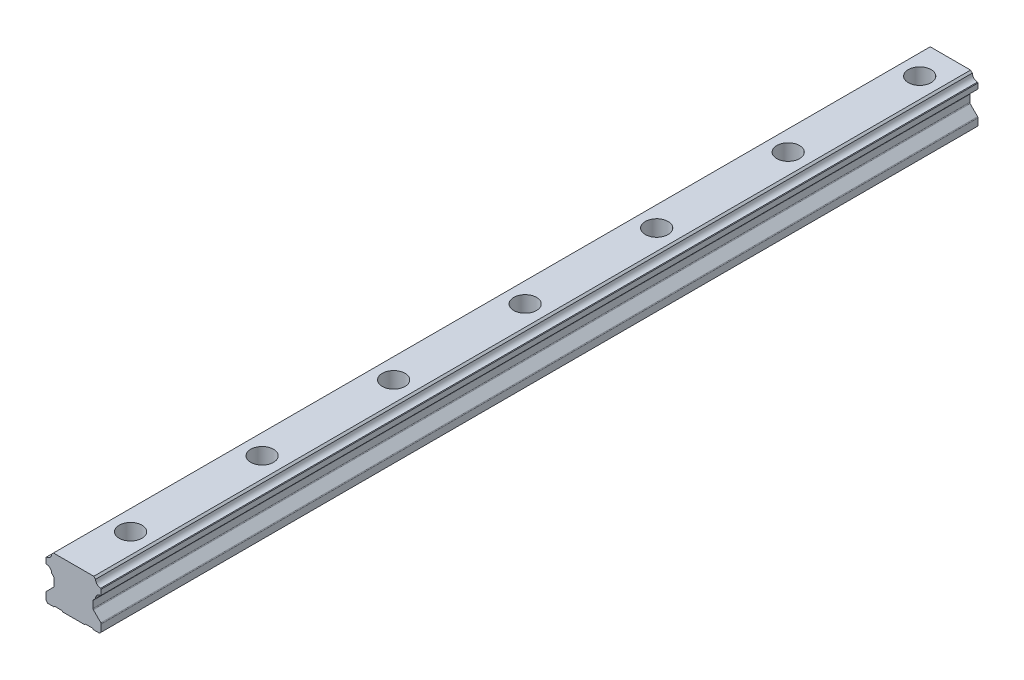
ISO-10303-21;
HEADER;
FILE_DESCRIPTION(('STEP AP214'),'2;1');
FILE_NAME('part.step','',(''),(''),'','','');
FILE_SCHEMA(('AUTOMOTIVE_DESIGN { 1 0 10303 214 1 1 1 1 }'));
ENDSEC;
DATA;
#1=APPLICATION_CONTEXT('core data for automotive mechanical design processes');
#2=APPLICATION_PROTOCOL_DEFINITION('international standard','automotive_design',2000,#1);
#3=PRODUCT_CONTEXT('',#1,'mechanical');
#4=PRODUCT('Part','Part','',(#3));
#5=PRODUCT_RELATED_PRODUCT_CATEGORY('part','',(#4));
#6=PRODUCT_DEFINITION_FORMATION('','',#4);
#7=PRODUCT_DEFINITION_CONTEXT('part definition',#1,'design');
#8=PRODUCT_DEFINITION('design','',#6,#7);
#9=PRODUCT_DEFINITION_SHAPE('','',#8);
#10=(LENGTH_UNIT() NAMED_UNIT(*) SI_UNIT(.MILLI.,.METRE.));
#11=(NAMED_UNIT(*) PLANE_ANGLE_UNIT() SI_UNIT($,.RADIAN.));
#12=(NAMED_UNIT(*) SI_UNIT($,.STERADIAN.) SOLID_ANGLE_UNIT());
#13=UNCERTAINTY_MEASURE_WITH_UNIT(LENGTH_MEASURE(1.E-05),#10,'distance_accuracy_value','');
#14=(GEOMETRIC_REPRESENTATION_CONTEXT(3) GLOBAL_UNCERTAINTY_ASSIGNED_CONTEXT((#13)) GLOBAL_UNIT_ASSIGNED_CONTEXT((#10,
#11,#12)) REPRESENTATION_CONTEXT('',''));
#15=CARTESIAN_POINT('',(0.,0.,0.));
#16=DIRECTION('',(0.,0.,1.));
#17=DIRECTION('',(1.,0.,0.));
#18=AXIS2_PLACEMENT_3D('',#15,#16,#17);
#19=CARTESIAN_POINT('',(31.2545531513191,5.66073086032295,1000.));
#20=DIRECTION('',(0.,0.,-1.));
#21=DIRECTION('',(-1.,0.,0.));
#22=AXIS2_PLACEMENT_3D('',#19,#20,#21);
#23=CYLINDRICAL_SURFACE('',#22,5.99999999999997);
#24=CARTESIAN_POINT('',(31.2545531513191,5.66073086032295,0.));
#25=DIRECTION('',(0.,0.,-1.));
#26=DIRECTION('',(1.,0.,0.));
#27=AXIS2_PLACEMENT_3D('',#24,#25,#26);
#28=CIRCLE('',#27,5.99999999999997);
#29=CARTESIAN_POINT('',(25.2556388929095,5.7748698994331,0.));
#30=VERTEX_POINT('',#29);
#31=CARTESIAN_POINT('',(31.1404141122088,11.6596451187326,0.));
#32=VERTEX_POINT('',#31);
#33=EDGE_CURVE('E326',#30,#32,#28,.T.);
#34=ORIENTED_EDGE('',*,*,#33,.T.);
#35=DIRECTION('',(0.,0.,-1.));
#36=VECTOR('',#35,1.);
#37=CARTESIAN_POINT('',(31.1404141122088,11.6596451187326,1000.));
#38=LINE('',#37,#36);
#39=CARTESIAN_POINT('',(31.1404141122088,11.6596451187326,1000.));
#40=VERTEX_POINT('',#39);
#41=EDGE_CURVE('E12',#40,#32,#38,.T.);
#42=ORIENTED_EDGE('',*,*,#41,.F.);
#43=CARTESIAN_POINT('',(31.2545531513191,5.66073086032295,1000.));
#44=DIRECTION('',(0.,0.,-1.));
#45=DIRECTION('',(1.,0.,0.));
#46=AXIS2_PLACEMENT_3D('',#43,#44,#45);
#47=CIRCLE('',#46,5.99999999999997);
#48=CARTESIAN_POINT('',(25.2556388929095,5.7748698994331,1000.));
#49=VERTEX_POINT('',#48);
#50=EDGE_CURVE('E439',#49,#40,#47,.T.);
#51=ORIENTED_EDGE('',*,*,#50,.F.);
#52=DIRECTION('',(0.,0.,-1.));
#53=VECTOR('',#52,1.);
#54=CARTESIAN_POINT('',(25.2556388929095,5.7748698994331,1000.));
#55=LINE('',#54,#53);
#56=EDGE_CURVE('E322',#49,#30,#55,.T.);
#57=ORIENTED_EDGE('',*,*,#56,.T.);
#58=EDGE_LOOP('',(#34,#42,#51,#57));
#59=FACE_BOUND('',#58,.T.);
#60=ADVANCED_FACE('F45',(#59),#23,.F.);
#61=CARTESIAN_POINT('',(31.1404141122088,11.6596451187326,1000.));
#62=DIRECTION('',(-0.707106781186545,0.70710678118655,0.));
#63=DIRECTION('',(-0.70710678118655,-0.707106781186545,0.));
#64=AXIS2_PLACEMENT_3D('',#61,#62,#63);
#65=PLANE('',#64);
#66=DIRECTION('',(0.70710678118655,0.707106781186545,0.));
#67=VECTOR('',#66,1.);
#68=CARTESIAN_POINT('',(31.1404141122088,11.6596451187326,0.));
#69=LINE('',#68,#67);
#70=CARTESIAN_POINT('',(31.7645310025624,12.2837620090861,0.));
#71=VERTEX_POINT('',#70);
#72=EDGE_CURVE('E330',#32,#71,#69,.T.);
#73=ORIENTED_EDGE('',*,*,#72,.T.);
#74=DIRECTION('',(0.,0.,-1.));
#75=VECTOR('',#74,1.);
#76=CARTESIAN_POINT('',(31.7645310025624,12.2837620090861,1000.));
#77=LINE('',#76,#75);
#78=CARTESIAN_POINT('',(31.7645310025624,12.2837620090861,1000.));
#79=VERTEX_POINT('',#78);
#80=EDGE_CURVE('E54',#79,#71,#77,.T.);
#81=ORIENTED_EDGE('',*,*,#80,.F.);
#82=DIRECTION('',(0.70710678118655,0.707106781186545,0.));
#83=VECTOR('',#82,1.);
#84=CARTESIAN_POINT('',(31.1404141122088,11.6596451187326,1000.));
#85=LINE('',#84,#83);
#86=EDGE_CURVE('E195',#40,#79,#85,.T.);
#87=ORIENTED_EDGE('',*,*,#86,.F.);
#88=ORIENTED_EDGE('',*,*,#41,.T.);
#89=EDGE_LOOP('',(#73,#81,#87,#88));
#90=FACE_BOUND('',#89,.T.);
#91=ADVANCED_FACE('F715',(#90),#65,.F.);
#92=CARTESIAN_POINT('',(31.7645310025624,12.2837620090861,1000.));
#93=DIRECTION('',(-1.,0.,0.));
#94=DIRECTION('',(0.,0.,1.));
#95=AXIS2_PLACEMENT_3D('',#92,#93,#94);
#96=PLANE('',#95);
#97=DIRECTION('',(0.,1.,0.));
#98=VECTOR('',#97,1.);
#99=CARTESIAN_POINT('',(31.7645310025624,12.2837620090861,0.));
#100=LINE('',#99,#98);
#101=CARTESIAN_POINT('',(31.7645310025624,18.2837945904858,0.));
#102=VERTEX_POINT('',#101);
#103=EDGE_CURVE('E334',#71,#102,#100,.T.);
#104=ORIENTED_EDGE('',*,*,#103,.T.);
#105=DIRECTION('',(0.,0.,-1.));
#106=VECTOR('',#105,1.);
#107=CARTESIAN_POINT('',(31.7645310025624,18.2837945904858,1000.));
#108=LINE('',#107,#106);
#109=CARTESIAN_POINT('',(31.7645310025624,18.2837945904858,1000.));
#110=VERTEX_POINT('',#109);
#111=EDGE_CURVE('E570',#110,#102,#108,.T.);
#112=ORIENTED_EDGE('',*,*,#111,.F.);
#113=DIRECTION('',(0.,1.,0.));
#114=VECTOR('',#113,1.);
#115=CARTESIAN_POINT('',(31.7645310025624,12.2837620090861,1000.));
#116=LINE('',#115,#114);
#117=EDGE_CURVE('E580',#79,#110,#116,.T.);
#118=ORIENTED_EDGE('',*,*,#117,.F.);
#119=ORIENTED_EDGE('',*,*,#80,.T.);
#120=EDGE_LOOP('',(#104,#112,#118,#119));
#121=FACE_BOUND('',#120,.T.);
#122=ADVANCED_FACE('F578',(#121),#96,.F.);
#123=CARTESIAN_POINT('',(31.7645310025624,18.2837945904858,1000.));
#124=DIRECTION('',(-0.707106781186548,-0.707106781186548,0.));
#125=DIRECTION('',(0.707106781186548,-0.707106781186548,0.));
#126=AXIS2_PLACEMENT_3D('',#123,#124,#125);
#127=PLANE('',#126);
#128=DIRECTION('',(-0.707106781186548,0.707106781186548,0.));
#129=VECTOR('',#128,1.);
#130=CARTESIAN_POINT('',(31.7645310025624,18.2837945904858,0.));
#131=LINE('',#130,#129);
#132=CARTESIAN_POINT('',(31.1394482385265,18.9088773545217,0.));
#133=VERTEX_POINT('',#132);
#134=EDGE_CURVE('E337',#102,#133,#131,.T.);
#135=ORIENTED_EDGE('',*,*,#134,.T.);
#136=DIRECTION('',(0.,0.,-1.));
#137=VECTOR('',#136,1.);
#138=CARTESIAN_POINT('',(31.1394482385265,18.9088773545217,1000.));
#139=LINE('',#138,#137);
#140=CARTESIAN_POINT('',(31.1394482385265,18.9088773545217,1000.));
#141=VERTEX_POINT('',#140);
#142=EDGE_CURVE('E566',#141,#133,#139,.T.);
#143=ORIENTED_EDGE('',*,*,#142,.F.);
#144=DIRECTION('',(-0.707106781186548,0.707106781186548,0.));
#145=VECTOR('',#144,1.);
#146=CARTESIAN_POINT('',(31.7645310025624,18.2837945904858,1000.));
#147=LINE('',#146,#145);
#148=EDGE_CURVE('E599',#110,#141,#147,.T.);
#149=ORIENTED_EDGE('',*,*,#148,.F.);
#150=ORIENTED_EDGE('',*,*,#111,.T.);
#151=EDGE_LOOP('',(#135,#143,#149,#150));
#152=FACE_BOUND('',#151,.T.);
#153=ADVANCED_FACE('F589',(#152),#127,.F.);
#154=CARTESIAN_POINT('',(31.2545531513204,24.9077731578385,1000.));
#155=DIRECTION('',(0.,0.,-1.));
#156=DIRECTION('',(-1.,0.,0.));
#157=AXIS2_PLACEMENT_3D('',#154,#155,#156);
#158=CYLINDRICAL_SURFACE('',#157,6.00000000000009);
#159=CARTESIAN_POINT('',(31.2545531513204,24.9077731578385,0.));
#160=DIRECTION('',(0.,0.,-1.));
#161=DIRECTION('',(1.,0.,0.));
#162=AXIS2_PLACEMENT_3D('',#159,#160,#161);
#163=CIRCLE('',#162,6.00000000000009);
#164=CARTESIAN_POINT('',(25.2556573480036,24.792668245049,0.));
#165=VERTEX_POINT('',#164);
#166=EDGE_CURVE('E340',#133,#165,#163,.T.);
#167=ORIENTED_EDGE('',*,*,#166,.T.);
#168=DIRECTION('',(0.,0.,-1.));
#169=VECTOR('',#168,1.);
#170=CARTESIAN_POINT('',(25.2556573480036,24.792668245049,1000.));
#171=LINE('',#170,#169);
#172=CARTESIAN_POINT('',(25.2556573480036,24.792668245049,1000.));
#173=VERTEX_POINT('',#172);
#174=EDGE_CURVE('E562',#173,#165,#171,.T.);
#175=ORIENTED_EDGE('',*,*,#174,.F.);
#176=CARTESIAN_POINT('',(31.2545531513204,24.9077731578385,1000.));
#177=DIRECTION('',(0.,0.,-1.));
#178=DIRECTION('',(1.,0.,0.));
#179=AXIS2_PLACEMENT_3D('',#176,#177,#178);
#180=CIRCLE('',#179,6.00000000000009);
#181=EDGE_CURVE('E595',#141,#173,#180,.T.);
#182=ORIENTED_EDGE('',*,*,#181,.F.);
#183=ORIENTED_EDGE('',*,*,#142,.T.);
#184=EDGE_LOOP('',(#167,#175,#182,#183));
#185=FACE_BOUND('',#184,.T.);
#186=ADVANCED_FACE('F593',(#185),#158,.F.);
#187=CARTESIAN_POINT('',(25.2556573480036,24.792668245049,1000.));
#188=DIRECTION('',(-0.707106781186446,-0.707106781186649,0.));
#189=DIRECTION('',(0.707106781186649,-0.707106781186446,0.));
#190=AXIS2_PLACEMENT_3D('',#187,#188,#189);
#191=PLANE('',#190);
#192=DIRECTION('',(-0.707106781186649,0.707106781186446,0.));
#193=VECTOR('',#192,1.);
#194=CARTESIAN_POINT('',(25.2556573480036,24.792668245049,0.));
#195=LINE('',#194,#193);
#196=CARTESIAN_POINT('',(23.2645615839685,26.7837640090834,0.));
#197=VERTEX_POINT('',#196);
#198=EDGE_CURVE('E343',#165,#197,#195,.T.);
#199=ORIENTED_EDGE('',*,*,#198,.T.);
#200=DIRECTION('',(0.,0.,-1.));
#201=VECTOR('',#200,1.);
#202=CARTESIAN_POINT('',(23.2645615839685,26.7837640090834,1000.));
#203=LINE('',#202,#201);
#204=CARTESIAN_POINT('',(23.2645615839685,26.7837640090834,1000.));
#205=VERTEX_POINT('',#204);
#206=EDGE_CURVE('E558',#205,#197,#203,.T.);
#207=ORIENTED_EDGE('',*,*,#206,.F.);
#208=DIRECTION('',(-0.707106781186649,0.707106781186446,0.));
#209=VECTOR('',#208,1.);
#210=CARTESIAN_POINT('',(25.2556573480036,24.792668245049,1000.));
#211=LINE('',#210,#209);
#212=EDGE_CURVE('E598',#173,#205,#211,.T.);
#213=ORIENTED_EDGE('',*,*,#212,.F.);
#214=ORIENTED_EDGE('',*,*,#174,.T.);
#215=EDGE_LOOP('',(#199,#207,#213,#214));
#216=FACE_BOUND('',#215,.T.);
#217=ADVANCED_FACE('F728',(#216),#191,.F.);
#218=CARTESIAN_POINT('',(23.2645615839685,26.7837640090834,1000.));
#219=DIRECTION('',(0.,-1.,0.));
#220=DIRECTION('',(1.,0.,0.));
#221=AXIS2_PLACEMENT_3D('',#218,#219,#220);
#222=PLANE('',#221);
#223=CARTESIAN_POINT('',(0.264531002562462,26.7837640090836,184.999999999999));
#224=DIRECTION('',(0.,1.,0.));
#225=DIRECTION('',(0.,0.,1.));
#226=AXIS2_PLACEMENT_3D('',#223,#224,#225);
#227=CIRCLE('',#226,13.);
#228=CARTESIAN_POINT('',(0.264531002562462,26.7837640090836,197.999999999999));
#229=VERTEX_POINT('',#228);
#230=EDGE_CURVE('E1418',#229,#229,#227,.T.);
#231=ORIENTED_EDGE('',*,*,#230,.F.);
#232=EDGE_LOOP('',(#231));
#233=FACE_BOUND('',#232,.T.);
#234=CARTESIAN_POINT('',(0.264531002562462,26.7837640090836,334.999999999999));
#235=DIRECTION('',(0.,1.,0.));
#236=DIRECTION('',(0.,0.,1.));
#237=AXIS2_PLACEMENT_3D('',#234,#235,#236);
#238=CIRCLE('',#237,13.);
#239=CARTESIAN_POINT('',(0.264531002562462,26.7837640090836,347.999999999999));
#240=VERTEX_POINT('',#239);
#241=EDGE_CURVE('E1432',#240,#240,#238,.T.);
#242=ORIENTED_EDGE('',*,*,#241,.F.);
#243=EDGE_LOOP('',(#242));
#244=FACE_BOUND('',#243,.T.);
#245=CARTESIAN_POINT('',(0.264531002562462,26.7837640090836,484.999999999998));
#246=DIRECTION('',(0.,1.,0.));
#247=DIRECTION('',(0.,0.,1.));
#248=AXIS2_PLACEMENT_3D('',#245,#246,#247);
#249=CIRCLE('',#248,13.);
#250=CARTESIAN_POINT('',(0.264531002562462,26.7837640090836,497.999999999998));
#251=VERTEX_POINT('',#250);
#252=EDGE_CURVE('E1448',#251,#251,#249,.T.);
#253=ORIENTED_EDGE('',*,*,#252,.F.);
#254=EDGE_LOOP('',(#253));
#255=FACE_BOUND('',#254,.T.);
#256=CARTESIAN_POINT('',(0.264531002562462,26.7837640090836,634.999999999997));
#257=DIRECTION('',(0.,1.,0.));
#258=DIRECTION('',(0.,0.,1.));
#259=AXIS2_PLACEMENT_3D('',#256,#257,#258);
#260=CIRCLE('',#259,13.);
#261=CARTESIAN_POINT('',(0.264531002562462,26.7837640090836,647.999999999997));
#262=VERTEX_POINT('',#261);
#263=EDGE_CURVE('E1464',#262,#262,#260,.T.);
#264=ORIENTED_EDGE('',*,*,#263,.F.);
#265=EDGE_LOOP('',(#264));
#266=FACE_BOUND('',#265,.T.);
#267=CARTESIAN_POINT('',(0.264531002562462,26.7837640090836,784.999999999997));
#268=DIRECTION('',(0.,1.,0.));
#269=DIRECTION('',(0.,0.,1.));
#270=AXIS2_PLACEMENT_3D('',#267,#268,#269);
#271=CIRCLE('',#270,13.);
#272=CARTESIAN_POINT('',(0.264531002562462,26.7837640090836,797.999999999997));
#273=VERTEX_POINT('',#272);
#274=EDGE_CURVE('E1480',#273,#273,#271,.T.);
#275=ORIENTED_EDGE('',*,*,#274,.F.);
#276=EDGE_LOOP('',(#275));
#277=FACE_BOUND('',#276,.T.);
#278=CARTESIAN_POINT('',(0.264531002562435,26.7837640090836,934.999999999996));
#279=DIRECTION('',(0.,1.,0.));
#280=DIRECTION('',(0.,0.,1.));
#281=AXIS2_PLACEMENT_3D('',#278,#279,#280);
#282=CIRCLE('',#281,13.);
#283=CARTESIAN_POINT('',(0.264531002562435,26.7837640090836,947.999999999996));
#284=VERTEX_POINT('',#283);
#285=EDGE_CURVE('E1496',#284,#284,#282,.T.);
#286=ORIENTED_EDGE('',*,*,#285,.F.);
#287=EDGE_LOOP('',(#286));
#288=FACE_BOUND('',#287,.T.);
#289=CARTESIAN_POINT('',(0.264531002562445,26.7837640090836,35.));
#290=DIRECTION('',(0.,1.,0.));
#291=DIRECTION('',(0.,0.,1.));
#292=AXIS2_PLACEMENT_3D('',#289,#290,#291);
#293=CIRCLE('',#292,13.);
#294=CARTESIAN_POINT('',(0.264531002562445,26.7837640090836,48.));
#295=VERTEX_POINT('',#294);
#296=EDGE_CURVE('E1512',#295,#295,#293,.T.);
#297=ORIENTED_EDGE('',*,*,#296,.F.);
#298=EDGE_LOOP('',(#297));
#299=FACE_BOUND('',#298,.T.);
#300=DIRECTION('',(-1.,0.,0.));
#301=VECTOR('',#300,1.);
#302=CARTESIAN_POINT('',(23.2645615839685,26.7837640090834,0.));
#303=LINE('',#302,#301);
#304=CARTESIAN_POINT('',(-22.7354995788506,26.7837640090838,0.));
#305=VERTEX_POINT('',#304);
#306=EDGE_CURVE('E346',#197,#305,#303,.T.);
#307=ORIENTED_EDGE('',*,*,#306,.T.);
#308=DIRECTION('',(0.,0.,-1.));
#309=VECTOR('',#308,1.);
#310=CARTESIAN_POINT('',(-22.7354995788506,26.7837640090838,1000.));
#311=LINE('',#310,#309);
#312=CARTESIAN_POINT('',(-22.7354995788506,26.7837640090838,1000.));
#313=VERTEX_POINT('',#312);
#314=EDGE_CURVE('E554',#313,#305,#311,.T.);
#315=ORIENTED_EDGE('',*,*,#314,.F.);
#316=DIRECTION('',(-1.,0.,0.));
#317=VECTOR('',#316,1.);
#318=CARTESIAN_POINT('',(23.2645615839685,26.7837640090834,1000.));
#319=LINE('',#318,#317);
#320=EDGE_CURVE('E603',#205,#313,#319,.T.);
#321=ORIENTED_EDGE('',*,*,#320,.F.);
#322=ORIENTED_EDGE('',*,*,#206,.T.);
#323=EDGE_LOOP('',(#307,#315,#321,#322));
#324=FACE_BOUND('',#323,.T.);
#325=ADVANCED_FACE('F731',(#233,#244,#255,#266,#277,#288,#299,#324),#222,.F.);
#326=CARTESIAN_POINT('',(-22.7354995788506,26.7837640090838,1000.));
#327=DIRECTION('',(0.707106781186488,-0.707106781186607,0.));
#328=DIRECTION('',(0.707106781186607,0.707106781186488,0.));
#329=AXIS2_PLACEMENT_3D('',#326,#327,#328);
#330=PLANE('',#329);
#331=DIRECTION('',(-0.707106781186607,-0.707106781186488,0.));
#332=VECTOR('',#331,1.);
#333=CARTESIAN_POINT('',(-22.7354995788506,26.7837640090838,0.));
#334=LINE('',#333,#332);
#335=CARTESIAN_POINT('',(-24.7265953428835,24.7926682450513,0.));
#336=VERTEX_POINT('',#335);
#337=EDGE_CURVE('E349',#305,#336,#334,.T.);
#338=ORIENTED_EDGE('',*,*,#337,.T.);
#339=DIRECTION('',(0.,0.,-1.));
#340=VECTOR('',#339,1.);
#341=CARTESIAN_POINT('',(-24.7265953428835,24.7926682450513,1000.));
#342=LINE('',#341,#340);
#343=CARTESIAN_POINT('',(-24.7265953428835,24.7926682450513,1000.));
#344=VERTEX_POINT('',#343);
#345=EDGE_CURVE('E550',#344,#336,#342,.T.);
#346=ORIENTED_EDGE('',*,*,#345,.F.);
#347=DIRECTION('',(-0.707106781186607,-0.707106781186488,0.));
#348=VECTOR('',#347,1.);
#349=CARTESIAN_POINT('',(-22.7354995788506,26.7837640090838,1000.));
#350=LINE('',#349,#348);
#351=EDGE_CURVE('E610',#313,#344,#350,.T.);
#352=ORIENTED_EDGE('',*,*,#351,.F.);
#353=ORIENTED_EDGE('',*,*,#314,.T.);
#354=EDGE_LOOP('',(#338,#346,#352,#353));
#355=FACE_BOUND('',#354,.T.);
#356=ADVANCED_FACE('F735',(#355),#330,.F.);
#357=CARTESIAN_POINT('',(-30.7254911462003,24.9077731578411,1000.));
#358=DIRECTION('',(0.,0.,-1.));
#359=DIRECTION('',(-1.,0.,0.));
#360=AXIS2_PLACEMENT_3D('',#357,#358,#359);
#361=CYLINDRICAL_SURFACE('',#360,6.00000000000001);
#362=CARTESIAN_POINT('',(-30.7254911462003,24.9077731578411,0.));
#363=DIRECTION('',(0.,0.,-1.));
#364=DIRECTION('',(1.,0.,0.));
#365=AXIS2_PLACEMENT_3D('',#362,#363,#364);
#366=CIRCLE('',#365,6.00000000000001);
#367=CARTESIAN_POINT('',(-30.6103862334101,18.9088773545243,0.));
#368=VERTEX_POINT('',#367);
#369=EDGE_CURVE('E352',#336,#368,#366,.T.);
#370=ORIENTED_EDGE('',*,*,#369,.T.);
#371=DIRECTION('',(0.,0.,-1.));
#372=VECTOR('',#371,1.);
#373=CARTESIAN_POINT('',(-30.6103862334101,18.9088773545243,1000.));
#374=LINE('',#373,#372);
#375=CARTESIAN_POINT('',(-30.6103862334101,18.9088773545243,1000.));
#376=VERTEX_POINT('',#375);
#377=EDGE_CURVE('E546',#376,#368,#374,.T.);
#378=ORIENTED_EDGE('',*,*,#377,.F.);
#379=CARTESIAN_POINT('',(-30.7254911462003,24.9077731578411,1000.));
#380=DIRECTION('',(0.,0.,-1.));
#381=DIRECTION('',(1.,0.,0.));
#382=AXIS2_PLACEMENT_3D('',#379,#380,#381);
#383=CIRCLE('',#382,6.00000000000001);
#384=EDGE_CURVE('E613',#344,#376,#383,.T.);
#385=ORIENTED_EDGE('',*,*,#384,.F.);
#386=ORIENTED_EDGE('',*,*,#345,.T.);
#387=EDGE_LOOP('',(#370,#378,#385,#386));
#388=FACE_BOUND('',#387,.T.);
#389=ADVANCED_FACE('F739',(#388),#361,.F.);
#390=CARTESIAN_POINT('',(-30.6103862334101,18.9088773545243,1000.));
#391=DIRECTION('',(0.707106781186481,-0.707106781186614,0.));
#392=DIRECTION('',(0.707106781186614,0.707106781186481,0.));
#393=AXIS2_PLACEMENT_3D('',#390,#391,#392);
#394=PLANE('',#393);
#395=DIRECTION('',(-0.707106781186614,-0.707106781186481,0.));
#396=VECTOR('',#395,1.);
#397=CARTESIAN_POINT('',(-30.6103862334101,18.9088773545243,0.));
#398=LINE('',#397,#396);
#399=CARTESIAN_POINT('',(-31.2354689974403,18.2837945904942,0.));
#400=VERTEX_POINT('',#399);
#401=EDGE_CURVE('E355',#368,#400,#398,.T.);
#402=ORIENTED_EDGE('',*,*,#401,.T.);
#403=DIRECTION('',(0.,0.,-1.));
#404=VECTOR('',#403,1.);
#405=CARTESIAN_POINT('',(-31.2354689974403,18.2837945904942,1000.));
#406=LINE('',#405,#404);
#407=CARTESIAN_POINT('',(-31.2354689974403,18.2837945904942,1000.));
#408=VERTEX_POINT('',#407);
#409=EDGE_CURVE('E542',#408,#400,#406,.T.);
#410=ORIENTED_EDGE('',*,*,#409,.F.);
#411=DIRECTION('',(-0.707106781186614,-0.707106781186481,0.));
#412=VECTOR('',#411,1.);
#413=CARTESIAN_POINT('',(-30.6103862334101,18.9088773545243,1000.));
#414=LINE('',#413,#412);
#415=EDGE_CURVE('E616',#376,#408,#414,.T.);
#416=ORIENTED_EDGE('',*,*,#415,.F.);
#417=ORIENTED_EDGE('',*,*,#377,.T.);
#418=EDGE_LOOP('',(#402,#410,#416,#417));
#419=FACE_BOUND('',#418,.T.);
#420=ADVANCED_FACE('F743',(#419),#394,.F.);
#421=CARTESIAN_POINT('',(-31.2354689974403,18.2837945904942,1000.));
#422=DIRECTION('',(1.,0.,0.));
#423=DIRECTION('',(0.,0.,-1.));
#424=AXIS2_PLACEMENT_3D('',#421,#422,#423);
#425=PLANE('',#424);
#426=DIRECTION('',(0.,-1.,0.));
#427=VECTOR('',#426,1.);
#428=CARTESIAN_POINT('',(-31.2354689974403,18.2837945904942,0.));
#429=LINE('',#428,#427);
#430=CARTESIAN_POINT('',(-31.2354689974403,12.2837620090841,0.));
#431=VERTEX_POINT('',#430);
#432=EDGE_CURVE('E358',#400,#431,#429,.T.);
#433=ORIENTED_EDGE('',*,*,#432,.T.);
#434=DIRECTION('',(0.,0.,-1.));
#435=VECTOR('',#434,1.);
#436=CARTESIAN_POINT('',(-31.2354689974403,12.2837620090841,1000.));
#437=LINE('',#436,#435);
#438=CARTESIAN_POINT('',(-31.2354689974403,12.2837620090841,1000.));
#439=VERTEX_POINT('',#438);
#440=EDGE_CURVE('E538',#439,#431,#437,.T.);
#441=ORIENTED_EDGE('',*,*,#440,.F.);
#442=DIRECTION('',(0.,-1.,0.));
#443=VECTOR('',#442,1.);
#444=CARTESIAN_POINT('',(-31.2354689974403,18.2837945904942,1000.));
#445=LINE('',#444,#443);
#446=EDGE_CURVE('E619',#408,#439,#445,.T.);
#447=ORIENTED_EDGE('',*,*,#446,.F.);
#448=ORIENTED_EDGE('',*,*,#409,.T.);
#449=EDGE_LOOP('',(#433,#441,#447,#448));
#450=FACE_BOUND('',#449,.T.);
#451=ADVANCED_FACE('F747',(#450),#425,.F.);
#452=CARTESIAN_POINT('',(-31.2354689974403,12.2837620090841,1000.));
#453=DIRECTION('',(0.707106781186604,0.707106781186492,0.));
#454=DIRECTION('',(-0.707106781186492,0.707106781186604,0.));
#455=AXIS2_PLACEMENT_3D('',#452,#453,#454);
#456=PLANE('',#455);
#457=DIRECTION('',(0.707106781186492,-0.707106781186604,0.));
#458=VECTOR('',#457,1.);
#459=CARTESIAN_POINT('',(-31.2354689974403,12.2837620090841,0.));
#460=LINE('',#459,#458);
#461=CARTESIAN_POINT('',(-30.6113521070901,11.6596451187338,0.));
#462=VERTEX_POINT('',#461);
#463=EDGE_CURVE('E361',#431,#462,#460,.T.);
#464=ORIENTED_EDGE('',*,*,#463,.T.);
#465=DIRECTION('',(0.,0.,-1.));
#466=VECTOR('',#465,1.);
#467=CARTESIAN_POINT('',(-30.6113521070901,11.6596451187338,1000.));
#468=LINE('',#467,#466);
#469=CARTESIAN_POINT('',(-30.6113521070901,11.6596451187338,1000.));
#470=VERTEX_POINT('',#469);
#471=EDGE_CURVE('E534',#470,#462,#468,.T.);
#472=ORIENTED_EDGE('',*,*,#471,.F.);
#473=DIRECTION('',(0.707106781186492,-0.707106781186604,0.));
#474=VECTOR('',#473,1.);
#475=CARTESIAN_POINT('',(-31.2354689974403,12.2837620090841,1000.));
#476=LINE('',#475,#474);
#477=EDGE_CURVE('E622',#439,#470,#476,.T.);
#478=ORIENTED_EDGE('',*,*,#477,.F.);
#479=ORIENTED_EDGE('',*,*,#440,.T.);
#480=EDGE_LOOP('',(#464,#472,#478,#479));
#481=FACE_BOUND('',#480,.T.);
#482=ADVANCED_FACE('F751',(#481),#456,.F.);
#483=CARTESIAN_POINT('',(-30.7254911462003,5.66073086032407,1000.));
#484=DIRECTION('',(0.,0.,-1.));
#485=DIRECTION('',(-1.,0.,0.));
#486=AXIS2_PLACEMENT_3D('',#483,#484,#485);
#487=CYLINDRICAL_SURFACE('',#486,6.00000000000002);
#488=CARTESIAN_POINT('',(-30.7254911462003,5.66073086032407,0.));
#489=DIRECTION('',(0.,0.,-1.));
#490=DIRECTION('',(1.,0.,0.));
#491=AXIS2_PLACEMENT_3D('',#488,#489,#490);
#492=CIRCLE('',#491,6.00000000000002);
#493=CARTESIAN_POINT('',(-24.7265768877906,5.77486989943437,0.));
#494=VERTEX_POINT('',#493);
#495=EDGE_CURVE('E364',#462,#494,#492,.T.);
#496=ORIENTED_EDGE('',*,*,#495,.T.);
#497=DIRECTION('',(0.,0.,-1.));
#498=VECTOR('',#497,1.);
#499=CARTESIAN_POINT('',(-24.7265768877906,5.77486989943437,1000.));
#500=LINE('',#499,#498);
#501=CARTESIAN_POINT('',(-24.7265768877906,5.77486989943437,1000.));
#502=VERTEX_POINT('',#501);
#503=EDGE_CURVE('E530',#502,#494,#500,.T.);
#504=ORIENTED_EDGE('',*,*,#503,.F.);
#505=CARTESIAN_POINT('',(-30.7254911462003,5.66073086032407,1000.));
#506=DIRECTION('',(0.,0.,-1.));
#507=DIRECTION('',(1.,0.,0.));
#508=AXIS2_PLACEMENT_3D('',#505,#506,#507);
#509=CIRCLE('',#508,6.00000000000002);
#510=EDGE_CURVE('E625',#470,#502,#509,.T.);
#511=ORIENTED_EDGE('',*,*,#510,.F.);
#512=ORIENTED_EDGE('',*,*,#471,.T.);
#513=EDGE_LOOP('',(#496,#504,#511,#512));
#514=FACE_BOUND('',#513,.T.);
#515=ADVANCED_FACE('F755',(#514),#487,.F.);
#516=CARTESIAN_POINT('',(-24.7265768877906,5.77486989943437,1000.));
#517=DIRECTION('',(0.707106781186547,0.707106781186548,0.));
#518=DIRECTION('',(-0.707106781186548,0.707106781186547,0.));
#519=AXIS2_PLACEMENT_3D('',#516,#517,#518);
#520=PLANE('',#519);
#521=DIRECTION('',(0.707106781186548,-0.707106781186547,0.));
#522=VECTOR('',#521,1.);
#523=CARTESIAN_POINT('',(-24.7265768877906,5.77486989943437,0.));
#524=LINE('',#523,#522);
#525=CARTESIAN_POINT('',(-22.2748088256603,3.32310183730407,0.));
#526=VERTEX_POINT('',#525);
#527=EDGE_CURVE('E367',#494,#526,#524,.T.);
#528=ORIENTED_EDGE('',*,*,#527,.T.);
#529=DIRECTION('',(0.,0.,-1.));
#530=VECTOR('',#529,1.);
#531=CARTESIAN_POINT('',(-22.2748088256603,3.32310183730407,1000.));
#532=LINE('',#531,#530);
#533=CARTESIAN_POINT('',(-22.2748088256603,3.32310183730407,1000.));
#534=VERTEX_POINT('',#533);
#535=EDGE_CURVE('E526',#534,#526,#532,.T.);
#536=ORIENTED_EDGE('',*,*,#535,.F.);
#537=DIRECTION('',(0.707106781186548,-0.707106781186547,0.));
#538=VECTOR('',#537,1.);
#539=CARTESIAN_POINT('',(-24.7265768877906,5.77486989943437,1000.));
#540=LINE('',#539,#538);
#541=EDGE_CURVE('E628',#502,#534,#540,.T.);
#542=ORIENTED_EDGE('',*,*,#541,.F.);
#543=ORIENTED_EDGE('',*,*,#503,.T.);
#544=EDGE_LOOP('',(#528,#536,#542,#543));
#545=FACE_BOUND('',#544,.T.);
#546=ADVANCED_FACE('F759',(#545),#520,.F.);
#547=CARTESIAN_POINT('',(-23.3354689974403,2.26244166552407,1000.));
#548=DIRECTION('',(0.,0.,-1.));
#549=DIRECTION('',(-1.,0.,0.));
#550=AXIS2_PLACEMENT_3D('',#547,#548,#549);
#551=CYLINDRICAL_SURFACE('',#550,1.50000000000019);
#552=CARTESIAN_POINT('',(-23.3354689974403,2.26244166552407,0.));
#553=DIRECTION('',(0.,0.,-1.));
#554=DIRECTION('',(1.,0.,0.));
#555=AXIS2_PLACEMENT_3D('',#552,#553,#554);
#556=CIRCLE('',#555,1.50000000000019);
#557=CARTESIAN_POINT('',(-21.8354689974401,2.26244166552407,0.));
#558=VERTEX_POINT('',#557);
#559=EDGE_CURVE('E370',#526,#558,#556,.T.);
#560=ORIENTED_EDGE('',*,*,#559,.T.);
#561=DIRECTION('',(0.,0.,-1.));
#562=VECTOR('',#561,1.);
#563=CARTESIAN_POINT('',(-21.8354689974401,2.26244166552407,1000.));
#564=LINE('',#563,#562);
#565=CARTESIAN_POINT('',(-21.8354689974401,2.26244166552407,1000.));
#566=VERTEX_POINT('',#565);
#567=EDGE_CURVE('E522',#566,#558,#564,.T.);
#568=ORIENTED_EDGE('',*,*,#567,.F.);
#569=CARTESIAN_POINT('',(-23.3354689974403,2.26244166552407,1000.));
#570=DIRECTION('',(0.,0.,-1.));
#571=DIRECTION('',(1.,0.,0.));
#572=AXIS2_PLACEMENT_3D('',#569,#570,#571);
#573=CIRCLE('',#572,1.50000000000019);
#574=EDGE_CURVE('E631',#534,#566,#573,.T.);
#575=ORIENTED_EDGE('',*,*,#574,.F.);
#576=ORIENTED_EDGE('',*,*,#535,.T.);
#577=EDGE_LOOP('',(#560,#568,#575,#576));
#578=FACE_BOUND('',#577,.T.);
#579=ADVANCED_FACE('F763',(#578),#551,.F.);
#580=CARTESIAN_POINT('',(-21.8354689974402,2.26244166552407,1000.));
#581=DIRECTION('',(1.,0.,0.));
#582=DIRECTION('',(0.,1.,0.));
#583=AXIS2_PLACEMENT_3D('',#580,#581,#582);
#584=PLANE('',#583);
#585=DIRECTION('',(0.,-1.,0.));
#586=VECTOR('',#585,1.);
#587=CARTESIAN_POINT('',(-21.8354689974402,2.26244166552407,0.));
#588=LINE('',#587,#586);
#589=CARTESIAN_POINT('',(-21.8354689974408,-5.55349429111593,0.));
#590=VERTEX_POINT('',#589);
#591=EDGE_CURVE('E373',#558,#590,#588,.T.);
#592=ORIENTED_EDGE('',*,*,#591,.T.);
#593=DIRECTION('',(0.,0.,-1.));
#594=VECTOR('',#593,1.);
#595=CARTESIAN_POINT('',(-21.8354689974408,-5.55349429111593,1000.));
#596=LINE('',#595,#594);
#597=CARTESIAN_POINT('',(-21.8354689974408,-5.55349429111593,1000.));
#598=VERTEX_POINT('',#597);
#599=EDGE_CURVE('E518',#598,#590,#596,.T.);
#600=ORIENTED_EDGE('',*,*,#599,.F.);
#601=DIRECTION('',(0.,-1.,0.));
#602=VECTOR('',#601,1.);
#603=CARTESIAN_POINT('',(-21.8354689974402,2.26244166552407,1000.));
#604=LINE('',#603,#602);
#605=EDGE_CURVE('E634',#566,#598,#604,.T.);
#606=ORIENTED_EDGE('',*,*,#605,.F.);
#607=ORIENTED_EDGE('',*,*,#567,.T.);
#608=EDGE_LOOP('',(#592,#600,#606,#607));
#609=FACE_BOUND('',#608,.T.);
#610=ADVANCED_FACE('F767',(#609),#584,.F.);
#611=CARTESIAN_POINT('',(-23.3354689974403,-5.55349429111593,1000.));
#612=DIRECTION('',(0.,0.,-1.));
#613=DIRECTION('',(-1.,0.,0.));
#614=AXIS2_PLACEMENT_3D('',#611,#612,#613);
#615=CYLINDRICAL_SURFACE('',#614,1.49999999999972);
#616=CARTESIAN_POINT('',(-23.3354689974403,-5.55349429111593,0.));
#617=DIRECTION('',(0.,0.,-1.));
#618=DIRECTION('',(1.,0.,0.));
#619=AXIS2_PLACEMENT_3D('',#616,#617,#618);
#620=CIRCLE('',#619,1.49999999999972);
#621=CARTESIAN_POINT('',(-22.2748088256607,-6.6141544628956,0.));
#622=VERTEX_POINT('',#621);
#623=EDGE_CURVE('E376',#590,#622,#620,.T.);
#624=ORIENTED_EDGE('',*,*,#623,.T.);
#625=DIRECTION('',(0.,0.,-1.));
#626=VECTOR('',#625,1.);
#627=CARTESIAN_POINT('',(-22.2748088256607,-6.6141544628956,1000.));
#628=LINE('',#627,#626);
#629=CARTESIAN_POINT('',(-22.2748088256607,-6.6141544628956,1000.));
#630=VERTEX_POINT('',#629);
#631=EDGE_CURVE('E514',#630,#622,#628,.T.);
#632=ORIENTED_EDGE('',*,*,#631,.F.);
#633=CARTESIAN_POINT('',(-23.3354689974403,-5.55349429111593,1000.));
#634=DIRECTION('',(0.,0.,-1.));
#635=DIRECTION('',(1.,0.,0.));
#636=AXIS2_PLACEMENT_3D('',#633,#634,#635);
#637=CIRCLE('',#636,1.49999999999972);
#638=EDGE_CURVE('E637',#598,#630,#637,.T.);
#639=ORIENTED_EDGE('',*,*,#638,.F.);
#640=ORIENTED_EDGE('',*,*,#599,.T.);
#641=EDGE_LOOP('',(#624,#632,#639,#640));
#642=FACE_BOUND('',#641,.T.);
#643=ADVANCED_FACE('F771',(#642),#615,.F.);
#644=CARTESIAN_POINT('',(-22.2748088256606,-6.61415446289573,1000.));
#645=DIRECTION('',(0.707106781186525,-0.70710678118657,0.));
#646=DIRECTION('',(0.70710678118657,0.707106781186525,0.));
#647=AXIS2_PLACEMENT_3D('',#644,#645,#646);
#648=PLANE('',#647);
#649=DIRECTION('',(-0.70710678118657,-0.707106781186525,0.));
#650=VECTOR('',#649,1.);
#651=CARTESIAN_POINT('',(-22.2748088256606,-6.61415446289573,0.));
#652=LINE('',#651,#650);
#653=CARTESIAN_POINT('',(-30.7961291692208,-15.1354748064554,0.));
#654=VERTEX_POINT('',#653);
#655=EDGE_CURVE('E379',#622,#654,#652,.T.);
#656=ORIENTED_EDGE('',*,*,#655,.T.);
#657=DIRECTION('',(0.,0.,-1.));
#658=VECTOR('',#657,1.);
#659=CARTESIAN_POINT('',(-30.7961291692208,-15.1354748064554,1000.));
#660=LINE('',#659,#658);
#661=CARTESIAN_POINT('',(-30.7961291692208,-15.1354748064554,1000.));
#662=VERTEX_POINT('',#661);
#663=EDGE_CURVE('E510',#662,#654,#660,.T.);
#664=ORIENTED_EDGE('',*,*,#663,.F.);
#665=DIRECTION('',(-0.70710678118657,-0.707106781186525,0.));
#666=VECTOR('',#665,1.);
#667=CARTESIAN_POINT('',(-22.2748088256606,-6.61415446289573,1000.));
#668=LINE('',#667,#666);
#669=EDGE_CURVE('E640',#630,#662,#668,.T.);
#670=ORIENTED_EDGE('',*,*,#669,.F.);
#671=ORIENTED_EDGE('',*,*,#631,.T.);
#672=EDGE_LOOP('',(#656,#664,#670,#671));
#673=FACE_BOUND('',#672,.T.);
#674=ADVANCED_FACE('F775',(#673),#648,.F.);
#675=CARTESIAN_POINT('',(-29.7354689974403,-16.1961349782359,1000.));
#676=DIRECTION('',(0.,0.,-1.));
#677=DIRECTION('',(-1.,0.,0.));
#678=AXIS2_PLACEMENT_3D('',#675,#676,#677);
#679=CYLINDRICAL_SURFACE('',#678,1.50000000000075);
#680=CARTESIAN_POINT('',(-29.7354689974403,-16.1961349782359,0.));
#681=DIRECTION('',(0.,0.,1.));
#682=DIRECTION('',(1.,0.,0.));
#683=AXIS2_PLACEMENT_3D('',#680,#681,#682);
#684=CIRCLE('',#683,1.50000000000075);
#685=CARTESIAN_POINT('',(-31.235468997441,-16.1961349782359,0.));
#686=VERTEX_POINT('',#685);
#687=EDGE_CURVE('E382',#654,#686,#684,.T.);
#688=ORIENTED_EDGE('',*,*,#687,.T.);
#689=DIRECTION('',(0.,0.,-1.));
#690=VECTOR('',#689,1.);
#691=CARTESIAN_POINT('',(-31.235468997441,-16.1961349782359,1000.));
#692=LINE('',#691,#690);
#693=CARTESIAN_POINT('',(-31.235468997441,-16.1961349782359,1000.));
#694=VERTEX_POINT('',#693);
#695=EDGE_CURVE('E506',#694,#686,#692,.T.);
#696=ORIENTED_EDGE('',*,*,#695,.F.);
#697=CARTESIAN_POINT('',(-29.7354689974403,-16.1961349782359,1000.));
#698=DIRECTION('',(0.,0.,1.));
#699=DIRECTION('',(1.,0.,0.));
#700=AXIS2_PLACEMENT_3D('',#697,#698,#699);
#701=CIRCLE('',#700,1.50000000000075);
#702=EDGE_CURVE('E643',#662,#694,#701,.T.);
#703=ORIENTED_EDGE('',*,*,#702,.F.);
#704=ORIENTED_EDGE('',*,*,#663,.T.);
#705=EDGE_LOOP('',(#688,#696,#703,#704));
#706=FACE_BOUND('',#705,.T.);
#707=ADVANCED_FACE('F779',(#706),#679,.T.);
#708=CARTESIAN_POINT('',(-31.2354689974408,-16.1961349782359,1000.));
#709=DIRECTION('',(1.,0.,0.));
#710=DIRECTION('',(0.,1.,0.));
#711=AXIS2_PLACEMENT_3D('',#708,#709,#710);
#712=PLANE('',#711);
#713=DIRECTION('',(0.,-1.,0.));
#714=VECTOR('',#713,1.);
#715=CARTESIAN_POINT('',(-31.2354689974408,-16.1961349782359,0.));
#716=LINE('',#715,#714);
#717=CARTESIAN_POINT('',(-31.2354689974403,-24.2162359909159,0.));
#718=VERTEX_POINT('',#717);
#719=EDGE_CURVE('E385',#686,#718,#716,.T.);
#720=ORIENTED_EDGE('',*,*,#719,.T.);
#721=DIRECTION('',(0.,0.,-1.));
#722=VECTOR('',#721,1.);
#723=CARTESIAN_POINT('',(-31.2354689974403,-24.2162359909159,1000.));
#724=LINE('',#723,#722);
#725=CARTESIAN_POINT('',(-31.2354689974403,-24.2162359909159,1000.));
#726=VERTEX_POINT('',#725);
#727=EDGE_CURVE('E502',#726,#718,#724,.T.);
#728=ORIENTED_EDGE('',*,*,#727,.F.);
#729=DIRECTION('',(0.,-1.,0.));
#730=VECTOR('',#729,1.);
#731=CARTESIAN_POINT('',(-31.2354689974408,-16.1961349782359,1000.));
#732=LINE('',#731,#730);
#733=EDGE_CURVE('E646',#694,#726,#732,.T.);
#734=ORIENTED_EDGE('',*,*,#733,.F.);
#735=ORIENTED_EDGE('',*,*,#695,.T.);
#736=EDGE_LOOP('',(#720,#728,#734,#735));
#737=FACE_BOUND('',#736,.T.);
#738=ADVANCED_FACE('F783',(#737),#712,.F.);
#739=CARTESIAN_POINT('',(-31.2354689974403,-24.2162359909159,1000.));
#740=DIRECTION('',(0.707106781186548,0.707106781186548,0.));
#741=DIRECTION('',(-0.707106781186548,0.707106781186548,0.));
#742=AXIS2_PLACEMENT_3D('',#739,#740,#741);
#743=PLANE('',#742);
#744=DIRECTION('',(0.707106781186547,-0.707106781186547,0.));
#745=VECTOR('',#744,1.);
#746=CARTESIAN_POINT('',(-31.2354689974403,-24.2162359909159,0.));
#747=LINE('',#746,#745);
#748=CARTESIAN_POINT('',(-29.2354689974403,-26.2162359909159,0.));
#749=VERTEX_POINT('',#748);
#750=EDGE_CURVE('E388',#718,#749,#747,.T.);
#751=ORIENTED_EDGE('',*,*,#750,.T.);
#752=DIRECTION('',(0.,0.,-1.));
#753=VECTOR('',#752,1.);
#754=CARTESIAN_POINT('',(-29.2354689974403,-26.2162359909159,1000.));
#755=LINE('',#754,#753);
#756=CARTESIAN_POINT('',(-29.2354689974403,-26.2162359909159,1000.));
#757=VERTEX_POINT('',#756);
#758=EDGE_CURVE('E498',#757,#749,#755,.T.);
#759=ORIENTED_EDGE('',*,*,#758,.F.);
#760=DIRECTION('',(0.707106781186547,-0.707106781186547,0.));
#761=VECTOR('',#760,1.);
#762=CARTESIAN_POINT('',(-31.2354689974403,-24.2162359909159,1000.));
#763=LINE('',#762,#761);
#764=EDGE_CURVE('E649',#726,#757,#763,.T.);
#765=ORIENTED_EDGE('',*,*,#764,.F.);
#766=ORIENTED_EDGE('',*,*,#727,.T.);
#767=EDGE_LOOP('',(#751,#759,#765,#766));
#768=FACE_BOUND('',#767,.T.);
#769=ADVANCED_FACE('F787',(#768),#743,.F.);
#770=CARTESIAN_POINT('',(-29.2354689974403,-26.2162359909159,1000.));
#771=DIRECTION('',(0.,1.,0.));
#772=DIRECTION('',(0.,0.,1.));
#773=AXIS2_PLACEMENT_3D('',#770,#771,#772);
#774=PLANE('',#773);
#775=DIRECTION('',(1.,0.,0.));
#776=VECTOR('',#775,1.);
#777=CARTESIAN_POINT('',(-29.2354689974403,-26.2162359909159,0.));
#778=LINE('',#777,#776);
#779=CARTESIAN_POINT('',(-22.2354689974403,-26.2162359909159,0.));
#780=VERTEX_POINT('',#779);
#781=EDGE_CURVE('E391',#749,#780,#778,.T.);
#782=ORIENTED_EDGE('',*,*,#781,.T.);
#783=DIRECTION('',(0.,0.,-1.));
#784=VECTOR('',#783,1.);
#785=CARTESIAN_POINT('',(-22.2354689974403,-26.2162359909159,1000.));
#786=LINE('',#785,#784);
#787=CARTESIAN_POINT('',(-22.2354689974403,-26.2162359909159,1000.));
#788=VERTEX_POINT('',#787);
#789=EDGE_CURVE('E494',#788,#780,#786,.T.);
#790=ORIENTED_EDGE('',*,*,#789,.F.);
#791=DIRECTION('',(1.,0.,0.));
#792=VECTOR('',#791,1.);
#793=CARTESIAN_POINT('',(-29.2354689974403,-26.2162359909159,1000.));
#794=LINE('',#793,#792);
#795=EDGE_CURVE('E652',#757,#788,#794,.T.);
#796=ORIENTED_EDGE('',*,*,#795,.F.);
#797=ORIENTED_EDGE('',*,*,#758,.T.);
#798=EDGE_LOOP('',(#782,#790,#796,#797));
#799=FACE_BOUND('',#798,.T.);
#800=ADVANCED_FACE('F791',(#799),#774,.F.);
#801=CARTESIAN_POINT('',(-22.2354689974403,-26.2162359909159,1000.));
#802=DIRECTION('',(-0.707110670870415,0.707102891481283,0.));
#803=DIRECTION('',(-0.707102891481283,-0.707110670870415,0.));
#804=AXIS2_PLACEMENT_3D('',#801,#802,#803);
#805=PLANE('',#804);
#806=DIRECTION('',(0.707102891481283,0.707110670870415,0.));
#807=VECTOR('',#806,1.);
#808=CARTESIAN_POINT('',(-22.2354689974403,-26.2162359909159,0.));
#809=LINE('',#808,#807);
#810=CARTESIAN_POINT('',(-21.2354799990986,-25.2162359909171,0.));
#811=VERTEX_POINT('',#810);
#812=EDGE_CURVE('E394',#780,#811,#809,.T.);
#813=ORIENTED_EDGE('',*,*,#812,.T.);
#814=DIRECTION('',(0.,0.,-1.));
#815=VECTOR('',#814,1.);
#816=CARTESIAN_POINT('',(-21.2354799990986,-25.2162359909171,1000.));
#817=LINE('',#816,#815);
#818=CARTESIAN_POINT('',(-21.2354799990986,-25.2162359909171,1000.));
#819=VERTEX_POINT('',#818);
#820=EDGE_CURVE('E490',#819,#811,#817,.T.);
#821=ORIENTED_EDGE('',*,*,#820,.F.);
#822=DIRECTION('',(0.707102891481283,0.707110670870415,0.));
#823=VECTOR('',#822,1.);
#824=CARTESIAN_POINT('',(-22.2354689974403,-26.2162359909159,1000.));
#825=LINE('',#824,#823);
#826=EDGE_CURVE('E655',#788,#819,#825,.T.);
#827=ORIENTED_EDGE('',*,*,#826,.F.);
#828=ORIENTED_EDGE('',*,*,#789,.T.);
#829=EDGE_LOOP('',(#813,#821,#827,#828));
#830=FACE_BOUND('',#829,.T.);
#831=ADVANCED_FACE('F795',(#830),#805,.F.);
#832=CARTESIAN_POINT('',(-21.2354799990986,-25.2162359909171,1000.));
#833=DIRECTION('',(0.,1.,0.));
#834=DIRECTION('',(0.,0.,1.));
#835=AXIS2_PLACEMENT_3D('',#832,#833,#834);
#836=PLANE('',#835);
#837=DIRECTION('',(1.,0.,0.));
#838=VECTOR('',#837,1.);
#839=CARTESIAN_POINT('',(-21.2354799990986,-25.2162359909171,0.));
#840=LINE('',#839,#838);
#841=CARTESIAN_POINT('',(-13.2354704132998,-25.2162359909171,0.));
#842=VERTEX_POINT('',#841);
#843=EDGE_CURVE('E397',#811,#842,#840,.T.);
#844=ORIENTED_EDGE('',*,*,#843,.T.);
#845=DIRECTION('',(0.,0.,-1.));
#846=VECTOR('',#845,1.);
#847=CARTESIAN_POINT('',(-13.2354704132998,-25.2162359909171,1000.));
#848=LINE('',#847,#846);
#849=CARTESIAN_POINT('',(-13.2354704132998,-25.2162359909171,1000.));
#850=VERTEX_POINT('',#849);
#851=EDGE_CURVE('E486',#850,#842,#848,.T.);
#852=ORIENTED_EDGE('',*,*,#851,.F.);
#853=DIRECTION('',(1.,0.,0.));
#854=VECTOR('',#853,1.);
#855=CARTESIAN_POINT('',(-21.2354799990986,-25.2162359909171,1000.));
#856=LINE('',#855,#854);
#857=EDGE_CURVE('E658',#819,#850,#856,.T.);
#858=ORIENTED_EDGE('',*,*,#857,.F.);
#859=ORIENTED_EDGE('',*,*,#820,.T.);
#860=EDGE_LOOP('',(#844,#852,#858,#859));
#861=FACE_BOUND('',#860,.T.);
#862=ADVANCED_FACE('F799',(#861),#836,.F.);
#863=CARTESIAN_POINT('',(-13.2354704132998,-25.2162359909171,1000.));
#864=DIRECTION('',(0.707106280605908,0.707107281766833,0.));
#865=DIRECTION('',(-0.707107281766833,0.707106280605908,0.));
#866=AXIS2_PLACEMENT_3D('',#863,#864,#865);
#867=PLANE('',#866);
#868=DIRECTION('',(0.707107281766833,-0.707106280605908,0.));
#869=VECTOR('',#868,1.);
#870=CARTESIAN_POINT('',(-13.2354704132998,-25.2162359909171,0.));
#871=LINE('',#870,#869);
#872=CARTESIAN_POINT('',(-12.2354689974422,-26.2162359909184,0.));
#873=VERTEX_POINT('',#872);
#874=EDGE_CURVE('E400',#842,#873,#871,.T.);
#875=ORIENTED_EDGE('',*,*,#874,.T.);
#876=DIRECTION('',(0.,0.,-1.));
#877=VECTOR('',#876,1.);
#878=CARTESIAN_POINT('',(-12.2354689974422,-26.2162359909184,1000.));
#879=LINE('',#878,#877);
#880=CARTESIAN_POINT('',(-12.2354689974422,-26.2162359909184,1000.));
#881=VERTEX_POINT('',#880);
#882=EDGE_CURVE('E482',#881,#873,#879,.T.);
#883=ORIENTED_EDGE('',*,*,#882,.F.);
#884=DIRECTION('',(0.707107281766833,-0.707106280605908,0.));
#885=VECTOR('',#884,1.);
#886=CARTESIAN_POINT('',(-13.2354704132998,-25.2162359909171,1000.));
#887=LINE('',#886,#885);
#888=EDGE_CURVE('E661',#850,#881,#887,.T.);
#889=ORIENTED_EDGE('',*,*,#888,.F.);
#890=ORIENTED_EDGE('',*,*,#851,.T.);
#891=EDGE_LOOP('',(#875,#883,#889,#890));
#892=FACE_BOUND('',#891,.T.);
#893=ADVANCED_FACE('F803',(#892),#867,.F.);
#894=CARTESIAN_POINT('',(-12.2354689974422,-26.2162359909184,1000.));
#895=DIRECTION('',(0.,1.,0.));
#896=DIRECTION('',(0.,0.,1.));
#897=AXIS2_PLACEMENT_3D('',#894,#895,#896);
#898=PLANE('',#897);
#899=CARTESIAN_POINT('',(0.264531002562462,-26.2162359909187,184.999999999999));
#900=DIRECTION('',(0.,1.,0.));
#901=DIRECTION('',(0.,0.,1.));
#902=AXIS2_PLACEMENT_3D('',#899,#900,#901);
#903=CIRCLE('',#902,8.99999999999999);
#904=CARTESIAN_POINT('',(0.264531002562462,-26.2162359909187,193.999999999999));
#905=VERTEX_POINT('',#904);
#906=EDGE_CURVE('E1428',#905,#905,#903,.T.);
#907=ORIENTED_EDGE('',*,*,#906,.T.);
#908=EDGE_LOOP('',(#907));
#909=FACE_BOUND('',#908,.T.);
#910=CARTESIAN_POINT('',(0.264531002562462,-26.2162359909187,334.999999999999));
#911=DIRECTION('',(0.,1.,0.));
#912=DIRECTION('',(0.,0.,1.));
#913=AXIS2_PLACEMENT_3D('',#910,#911,#912);
#914=CIRCLE('',#913,8.99999999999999);
#915=CARTESIAN_POINT('',(0.264531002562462,-26.2162359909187,343.999999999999));
#916=VERTEX_POINT('',#915);
#917=EDGE_CURVE('E1444',#916,#916,#914,.T.);
#918=ORIENTED_EDGE('',*,*,#917,.T.);
#919=EDGE_LOOP('',(#918));
#920=FACE_BOUND('',#919,.T.);
#921=CARTESIAN_POINT('',(0.264531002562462,-26.2162359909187,484.999999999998));
#922=DIRECTION('',(0.,1.,0.));
#923=DIRECTION('',(0.,0.,1.));
#924=AXIS2_PLACEMENT_3D('',#921,#922,#923);
#925=CIRCLE('',#924,8.99999999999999);
#926=CARTESIAN_POINT('',(0.264531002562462,-26.2162359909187,493.999999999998));
#927=VERTEX_POINT('',#926);
#928=EDGE_CURVE('E1460',#927,#927,#925,.T.);
#929=ORIENTED_EDGE('',*,*,#928,.T.);
#930=EDGE_LOOP('',(#929));
#931=FACE_BOUND('',#930,.T.);
#932=CARTESIAN_POINT('',(0.264531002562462,-26.2162359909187,634.999999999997));
#933=DIRECTION('',(0.,1.,0.));
#934=DIRECTION('',(0.,0.,1.));
#935=AXIS2_PLACEMENT_3D('',#932,#933,#934);
#936=CIRCLE('',#935,8.99999999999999);
#937=CARTESIAN_POINT('',(0.264531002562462,-26.2162359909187,643.999999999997));
#938=VERTEX_POINT('',#937);
#939=EDGE_CURVE('E1476',#938,#938,#936,.T.);
#940=ORIENTED_EDGE('',*,*,#939,.T.);
#941=EDGE_LOOP('',(#940));
#942=FACE_BOUND('',#941,.T.);
#943=CARTESIAN_POINT('',(0.264531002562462,-26.2162359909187,784.999999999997));
#944=DIRECTION('',(0.,1.,0.));
#945=DIRECTION('',(0.,0.,1.));
#946=AXIS2_PLACEMENT_3D('',#943,#944,#945);
#947=CIRCLE('',#946,8.99999999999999);
#948=CARTESIAN_POINT('',(0.264531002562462,-26.2162359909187,793.999999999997));
#949=VERTEX_POINT('',#948);
#950=EDGE_CURVE('E1492',#949,#949,#947,.T.);
#951=ORIENTED_EDGE('',*,*,#950,.T.);
#952=EDGE_LOOP('',(#951));
#953=FACE_BOUND('',#952,.T.);
#954=CARTESIAN_POINT('',(0.264531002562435,-26.2162359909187,934.999999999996));
#955=DIRECTION('',(0.,1.,0.));
#956=DIRECTION('',(0.,0.,1.));
#957=AXIS2_PLACEMENT_3D('',#954,#955,#956);
#958=CIRCLE('',#957,8.99999999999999);
#959=CARTESIAN_POINT('',(0.264531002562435,-26.2162359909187,943.999999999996));
#960=VERTEX_POINT('',#959);
#961=EDGE_CURVE('E1508',#960,#960,#958,.T.);
#962=ORIENTED_EDGE('',*,*,#961,.T.);
#963=EDGE_LOOP('',(#962));
#964=FACE_BOUND('',#963,.T.);
#965=CARTESIAN_POINT('',(0.264531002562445,-26.2162359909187,35.));
#966=DIRECTION('',(0.,1.,0.));
#967=DIRECTION('',(0.,0.,1.));
#968=AXIS2_PLACEMENT_3D('',#965,#966,#967);
#969=CIRCLE('',#968,8.99999999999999);
#970=CARTESIAN_POINT('',(0.264531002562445,-26.2162359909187,44.));
#971=VERTEX_POINT('',#970);
#972=EDGE_CURVE('E331',#971,#971,#969,.T.);
#973=ORIENTED_EDGE('',*,*,#972,.T.);
#974=EDGE_LOOP('',(#973));
#975=FACE_BOUND('',#974,.T.);
#976=DIRECTION('',(1.,0.,0.));
#977=VECTOR('',#976,1.);
#978=CARTESIAN_POINT('',(-12.2354689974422,-26.2162359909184,0.));
#979=LINE('',#978,#977);
#980=CARTESIAN_POINT('',(12.7645310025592,-26.2162359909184,0.));
#981=VERTEX_POINT('',#980);
#982=EDGE_CURVE('E403',#873,#981,#979,.T.);
#983=ORIENTED_EDGE('',*,*,#982,.T.);
#984=DIRECTION('',(0.,0.,-1.));
#985=VECTOR('',#984,1.);
#986=CARTESIAN_POINT('',(12.7645310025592,-26.2162359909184,1000.));
#987=LINE('',#986,#985);
#988=CARTESIAN_POINT('',(12.7645310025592,-26.2162359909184,1000.));
#989=VERTEX_POINT('',#988);
#990=EDGE_CURVE('E478',#989,#981,#987,.T.);
#991=ORIENTED_EDGE('',*,*,#990,.F.);
#992=DIRECTION('',(1.,0.,0.));
#993=VECTOR('',#992,1.);
#994=CARTESIAN_POINT('',(-12.2354689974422,-26.2162359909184,1000.));
#995=LINE('',#994,#993);
#996=EDGE_CURVE('E664',#881,#989,#995,.T.);
#997=ORIENTED_EDGE('',*,*,#996,.F.);
#998=ORIENTED_EDGE('',*,*,#882,.T.);
#999=EDGE_LOOP('',(#983,#991,#997,#998));
#1000=FACE_BOUND('',#999,.T.);
#1001=ADVANCED_FACE('F807',(#909,#920,#931,#942,#953,#964,#975,#1000),#898,.F.);
#1002=CARTESIAN_POINT('',(12.7645310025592,-26.2162359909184,1000.));
#1003=DIRECTION('',(-0.707106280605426,0.707107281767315,0.));
#1004=DIRECTION('',(-0.707107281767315,-0.707106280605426,0.));
#1005=AXIS2_PLACEMENT_3D('',#1002,#1003,#1004);
#1006=PLANE('',#1005);
#1007=DIRECTION('',(0.707107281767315,0.707106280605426,0.));
#1008=VECTOR('',#1007,1.);
#1009=CARTESIAN_POINT('',(12.7645310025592,-26.2162359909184,0.));
#1010=LINE('',#1009,#1008);
#1011=CARTESIAN_POINT('',(13.764532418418,-25.2162359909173,0.));
#1012=VERTEX_POINT('',#1011);
#1013=EDGE_CURVE('E406',#981,#1012,#1010,.T.);
#1014=ORIENTED_EDGE('',*,*,#1013,.T.);
#1015=DIRECTION('',(0.,0.,-1.));
#1016=VECTOR('',#1015,1.);
#1017=CARTESIAN_POINT('',(13.764532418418,-25.2162359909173,1000.));
#1018=LINE('',#1017,#1016);
#1019=CARTESIAN_POINT('',(13.764532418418,-25.2162359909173,1000.));
#1020=VERTEX_POINT('',#1019);
#1021=EDGE_CURVE('E474',#1020,#1012,#1018,.T.);
#1022=ORIENTED_EDGE('',*,*,#1021,.F.);
#1023=DIRECTION('',(0.707107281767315,0.707106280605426,0.));
#1024=VECTOR('',#1023,1.);
#1025=CARTESIAN_POINT('',(12.7645310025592,-26.2162359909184,1000.));
#1026=LINE('',#1025,#1024);
#1027=EDGE_CURVE('E667',#989,#1020,#1026,.T.);
#1028=ORIENTED_EDGE('',*,*,#1027,.F.);
#1029=ORIENTED_EDGE('',*,*,#990,.T.);
#1030=EDGE_LOOP('',(#1014,#1022,#1028,#1029));
#1031=FACE_BOUND('',#1030,.T.);
#1032=ADVANCED_FACE('F811',(#1031),#1006,.F.);
#1033=CARTESIAN_POINT('',(13.764532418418,-25.2162359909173,1000.));
#1034=DIRECTION('',(0.,1.,0.));
#1035=DIRECTION('',(0.,0.,1.));
#1036=AXIS2_PLACEMENT_3D('',#1033,#1034,#1035);
#1037=PLANE('',#1036);
#1038=DIRECTION('',(1.,0.,0.));
#1039=VECTOR('',#1038,1.);
#1040=CARTESIAN_POINT('',(13.764532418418,-25.2162359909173,0.));
#1041=LINE('',#1040,#1039);
#1042=CARTESIAN_POINT('',(21.7645420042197,-25.2162359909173,0.));
#1043=VERTEX_POINT('',#1042);
#1044=EDGE_CURVE('E409',#1012,#1043,#1041,.T.);
#1045=ORIENTED_EDGE('',*,*,#1044,.T.);
#1046=DIRECTION('',(0.,0.,-1.));
#1047=VECTOR('',#1046,1.);
#1048=CARTESIAN_POINT('',(21.7645420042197,-25.2162359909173,1000.));
#1049=LINE('',#1048,#1047);
#1050=CARTESIAN_POINT('',(21.7645420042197,-25.2162359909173,1000.));
#1051=VERTEX_POINT('',#1050);
#1052=EDGE_CURVE('E470',#1051,#1043,#1049,.T.);
#1053=ORIENTED_EDGE('',*,*,#1052,.F.);
#1054=DIRECTION('',(1.,0.,0.));
#1055=VECTOR('',#1054,1.);
#1056=CARTESIAN_POINT('',(13.764532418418,-25.2162359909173,1000.));
#1057=LINE('',#1056,#1055);
#1058=EDGE_CURVE('E670',#1020,#1051,#1057,.T.);
#1059=ORIENTED_EDGE('',*,*,#1058,.F.);
#1060=ORIENTED_EDGE('',*,*,#1021,.T.);
#1061=EDGE_LOOP('',(#1045,#1053,#1059,#1060));
#1062=FACE_BOUND('',#1061,.T.);
#1063=ADVANCED_FACE('F815',(#1062),#1037,.F.);
#1064=CARTESIAN_POINT('',(21.7645420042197,-25.2162359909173,1000.));
#1065=DIRECTION('',(0.707110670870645,0.707102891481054,0.));
#1066=DIRECTION('',(-0.707102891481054,0.707110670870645,0.));
#1067=AXIS2_PLACEMENT_3D('',#1064,#1065,#1066);
#1068=PLANE('',#1067);
#1069=DIRECTION('',(0.707102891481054,-0.707110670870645,0.));
#1070=VECTOR('',#1069,1.);
#1071=CARTESIAN_POINT('',(21.7645420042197,-25.2162359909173,0.));
#1072=LINE('',#1071,#1070);
#1073=CARTESIAN_POINT('',(22.764531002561,-26.2162359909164,0.));
#1074=VERTEX_POINT('',#1073);
#1075=EDGE_CURVE('E412',#1043,#1074,#1072,.T.);
#1076=ORIENTED_EDGE('',*,*,#1075,.T.);
#1077=DIRECTION('',(0.,0.,-1.));
#1078=VECTOR('',#1077,1.);
#1079=CARTESIAN_POINT('',(22.764531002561,-26.2162359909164,1000.));
#1080=LINE('',#1079,#1078);
#1081=CARTESIAN_POINT('',(22.764531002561,-26.2162359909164,1000.));
#1082=VERTEX_POINT('',#1081);
#1083=EDGE_CURVE('E466',#1082,#1074,#1080,.T.);
#1084=ORIENTED_EDGE('',*,*,#1083,.F.);
#1085=DIRECTION('',(0.707102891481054,-0.707110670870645,0.));
#1086=VECTOR('',#1085,1.);
#1087=CARTESIAN_POINT('',(21.7645420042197,-25.2162359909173,1000.));
#1088=LINE('',#1087,#1086);
#1089=EDGE_CURVE('E673',#1051,#1082,#1088,.T.);
#1090=ORIENTED_EDGE('',*,*,#1089,.F.);
#1091=ORIENTED_EDGE('',*,*,#1052,.T.);
#1092=EDGE_LOOP('',(#1076,#1084,#1090,#1091));
#1093=FACE_BOUND('',#1092,.T.);
#1094=ADVANCED_FACE('F819',(#1093),#1068,.F.);
#1095=CARTESIAN_POINT('',(22.764531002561,-26.2162359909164,1000.));
#1096=DIRECTION('',(0.,1.,0.));
#1097=DIRECTION('',(0.,0.,1.));
#1098=AXIS2_PLACEMENT_3D('',#1095,#1096,#1097);
#1099=PLANE('',#1098);
#1100=DIRECTION('',(1.,0.,0.));
#1101=VECTOR('',#1100,1.);
#1102=CARTESIAN_POINT('',(22.764531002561,-26.2162359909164,0.));
#1103=LINE('',#1102,#1101);
#1104=CARTESIAN_POINT('',(29.7645310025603,-26.2162359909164,0.));
#1105=VERTEX_POINT('',#1104);
#1106=EDGE_CURVE('E415',#1074,#1105,#1103,.T.);
#1107=ORIENTED_EDGE('',*,*,#1106,.T.);
#1108=DIRECTION('',(0.,0.,-1.));
#1109=VECTOR('',#1108,1.);
#1110=CARTESIAN_POINT('',(29.7645310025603,-26.2162359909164,1000.));
#1111=LINE('',#1110,#1109);
#1112=CARTESIAN_POINT('',(29.7645310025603,-26.2162359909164,1000.));
#1113=VERTEX_POINT('',#1112);
#1114=EDGE_CURVE('E462',#1113,#1105,#1111,.T.);
#1115=ORIENTED_EDGE('',*,*,#1114,.F.);
#1116=DIRECTION('',(1.,0.,0.));
#1117=VECTOR('',#1116,1.);
#1118=CARTESIAN_POINT('',(22.764531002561,-26.2162359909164,1000.));
#1119=LINE('',#1118,#1117);
#1120=EDGE_CURVE('E676',#1082,#1113,#1119,.T.);
#1121=ORIENTED_EDGE('',*,*,#1120,.F.);
#1122=ORIENTED_EDGE('',*,*,#1083,.T.);
#1123=EDGE_LOOP('',(#1107,#1115,#1121,#1122));
#1124=FACE_BOUND('',#1123,.T.);
#1125=ADVANCED_FACE('F823',(#1124),#1099,.F.);
#1126=CARTESIAN_POINT('',(29.7645310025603,-26.2162359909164,1000.));
#1127=DIRECTION('',(-0.707106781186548,0.707106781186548,0.));
#1128=DIRECTION('',(-0.707106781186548,-0.707106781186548,0.));
#1129=AXIS2_PLACEMENT_3D('',#1126,#1127,#1128);
#1130=PLANE('',#1129);
#1131=DIRECTION('',(0.707106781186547,0.707106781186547,0.));
#1132=VECTOR('',#1131,1.);
#1133=CARTESIAN_POINT('',(29.7645310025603,-26.2162359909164,0.));
#1134=LINE('',#1133,#1132);
#1135=CARTESIAN_POINT('',(31.7645310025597,-24.2162359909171,0.));
#1136=VERTEX_POINT('',#1135);
#1137=EDGE_CURVE('E418',#1105,#1136,#1134,.T.);
#1138=ORIENTED_EDGE('',*,*,#1137,.T.);
#1139=DIRECTION('',(0.,0.,-1.));
#1140=VECTOR('',#1139,1.);
#1141=CARTESIAN_POINT('',(31.7645310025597,-24.2162359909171,1000.));
#1142=LINE('',#1141,#1140);
#1143=CARTESIAN_POINT('',(31.7645310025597,-24.2162359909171,1000.));
#1144=VERTEX_POINT('',#1143);
#1145=EDGE_CURVE('E458',#1144,#1136,#1142,.T.);
#1146=ORIENTED_EDGE('',*,*,#1145,.F.);
#1147=DIRECTION('',(0.707106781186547,0.707106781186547,0.));
#1148=VECTOR('',#1147,1.);
#1149=CARTESIAN_POINT('',(29.7645310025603,-26.2162359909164,1000.));
#1150=LINE('',#1149,#1148);
#1151=EDGE_CURVE('E679',#1113,#1144,#1150,.T.);
#1152=ORIENTED_EDGE('',*,*,#1151,.F.);
#1153=ORIENTED_EDGE('',*,*,#1114,.T.);
#1154=EDGE_LOOP('',(#1138,#1146,#1152,#1153));
#1155=FACE_BOUND('',#1154,.T.);
#1156=ADVANCED_FACE('F827',(#1155),#1130,.F.);
#1157=CARTESIAN_POINT('',(31.7645310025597,-24.2162359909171,1000.));
#1158=DIRECTION('',(-1.,0.,0.));
#1159=DIRECTION('',(0.,0.,1.));
#1160=AXIS2_PLACEMENT_3D('',#1157,#1158,#1159);
#1161=PLANE('',#1160);
#1162=DIRECTION('',(0.,1.,0.));
#1163=VECTOR('',#1162,1.);
#1164=CARTESIAN_POINT('',(31.7645310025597,-24.2162359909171,0.));
#1165=LINE('',#1164,#1163);
#1166=CARTESIAN_POINT('',(31.7645310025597,-16.1961349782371,0.));
#1167=VERTEX_POINT('',#1166);
#1168=EDGE_CURVE('E421',#1136,#1167,#1165,.T.);
#1169=ORIENTED_EDGE('',*,*,#1168,.T.);
#1170=DIRECTION('',(0.,0.,-1.));
#1171=VECTOR('',#1170,1.);
#1172=CARTESIAN_POINT('',(31.7645310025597,-16.1961349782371,1000.));
#1173=LINE('',#1172,#1171);
#1174=CARTESIAN_POINT('',(31.7645310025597,-16.1961349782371,1000.));
#1175=VERTEX_POINT('',#1174);
#1176=EDGE_CURVE('E454',#1175,#1167,#1173,.T.);
#1177=ORIENTED_EDGE('',*,*,#1176,.F.);
#1178=DIRECTION('',(0.,1.,0.));
#1179=VECTOR('',#1178,1.);
#1180=CARTESIAN_POINT('',(31.7645310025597,-24.2162359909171,1000.));
#1181=LINE('',#1180,#1179);
#1182=EDGE_CURVE('E682',#1144,#1175,#1181,.T.);
#1183=ORIENTED_EDGE('',*,*,#1182,.F.);
#1184=ORIENTED_EDGE('',*,*,#1145,.T.);
#1185=EDGE_LOOP('',(#1169,#1177,#1183,#1184));
#1186=FACE_BOUND('',#1185,.T.);
#1187=ADVANCED_FACE('F831',(#1186),#1161,.F.);
#1188=CARTESIAN_POINT('',(30.2645310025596,-16.1961349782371,1000.));
#1189=DIRECTION('',(0.,0.,-1.));
#1190=DIRECTION('',(-1.,0.,0.));
#1191=AXIS2_PLACEMENT_3D('',#1188,#1189,#1190);
#1192=CYLINDRICAL_SURFACE('',#1191,1.50000000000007);
#1193=CARTESIAN_POINT('',(30.2645310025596,-16.1961349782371,0.));
#1194=DIRECTION('',(0.,0.,1.));
#1195=DIRECTION('',(1.,0.,0.));
#1196=AXIS2_PLACEMENT_3D('',#1193,#1194,#1195);
#1197=CIRCLE('',#1196,1.50000000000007);
#1198=CARTESIAN_POINT('',(31.3251911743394,-15.1354748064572,0.));
#1199=VERTEX_POINT('',#1198);
#1200=EDGE_CURVE('E424',#1167,#1199,#1197,.T.);
#1201=ORIENTED_EDGE('',*,*,#1200,.T.);
#1202=DIRECTION('',(0.,0.,-1.));
#1203=VECTOR('',#1202,1.);
#1204=CARTESIAN_POINT('',(31.3251911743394,-15.1354748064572,1000.));
#1205=LINE('',#1204,#1203);
#1206=CARTESIAN_POINT('',(31.3251911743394,-15.1354748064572,1000.));
#1207=VERTEX_POINT('',#1206);
#1208=EDGE_CURVE('E450',#1207,#1199,#1205,.T.);
#1209=ORIENTED_EDGE('',*,*,#1208,.F.);
#1210=CARTESIAN_POINT('',(30.2645310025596,-16.1961349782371,1000.));
#1211=DIRECTION('',(0.,0.,1.));
#1212=DIRECTION('',(1.,0.,0.));
#1213=AXIS2_PLACEMENT_3D('',#1210,#1211,#1212);
#1214=CIRCLE('',#1213,1.50000000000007);
#1215=EDGE_CURVE('E685',#1175,#1207,#1214,.T.);
#1216=ORIENTED_EDGE('',*,*,#1215,.F.);
#1217=ORIENTED_EDGE('',*,*,#1176,.T.);
#1218=EDGE_LOOP('',(#1201,#1209,#1216,#1217));
#1219=FACE_BOUND('',#1218,.T.);
#1220=ADVANCED_FACE('F835',(#1219),#1192,.T.);
#1221=CARTESIAN_POINT('',(31.3251911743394,-15.1354748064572,1000.));
#1222=DIRECTION('',(-0.707106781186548,-0.707106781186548,0.));
#1223=DIRECTION('',(0.707106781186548,-0.707106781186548,0.));
#1224=AXIS2_PLACEMENT_3D('',#1221,#1222,#1223);
#1225=PLANE('',#1224);
#1226=DIRECTION('',(-0.707106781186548,0.707106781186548,0.));
#1227=VECTOR('',#1226,1.);
#1228=CARTESIAN_POINT('',(31.3251911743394,-15.1354748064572,0.));
#1229=LINE('',#1228,#1227);
#1230=CARTESIAN_POINT('',(22.8038708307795,-6.61415446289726,0.));
#1231=VERTEX_POINT('',#1230);
#1232=EDGE_CURVE('E427',#1199,#1231,#1229,.T.);
#1233=ORIENTED_EDGE('',*,*,#1232,.T.);
#1234=DIRECTION('',(0.,0.,-1.));
#1235=VECTOR('',#1234,1.);
#1236=CARTESIAN_POINT('',(22.8038708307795,-6.61415446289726,1000.));
#1237=LINE('',#1236,#1235);
#1238=CARTESIAN_POINT('',(22.8038708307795,-6.61415446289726,1000.));
#1239=VERTEX_POINT('',#1238);
#1240=EDGE_CURVE('E446',#1239,#1231,#1237,.T.);
#1241=ORIENTED_EDGE('',*,*,#1240,.F.);
#1242=DIRECTION('',(-0.707106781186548,0.707106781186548,0.));
#1243=VECTOR('',#1242,1.);
#1244=CARTESIAN_POINT('',(31.3251911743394,-15.1354748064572,1000.));
#1245=LINE('',#1244,#1243);
#1246=EDGE_CURVE('E688',#1207,#1239,#1245,.T.);
#1247=ORIENTED_EDGE('',*,*,#1246,.F.);
#1248=ORIENTED_EDGE('',*,*,#1208,.T.);
#1249=EDGE_LOOP('',(#1233,#1241,#1247,#1248));
#1250=FACE_BOUND('',#1249,.T.);
#1251=ADVANCED_FACE('F696',(#1250),#1225,.F.);
#1252=CARTESIAN_POINT('',(23.8645310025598,-5.55349429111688,1000.));
#1253=DIRECTION('',(0.,0.,-1.));
#1254=DIRECTION('',(-1.,0.,0.));
#1255=AXIS2_PLACEMENT_3D('',#1252,#1253,#1254);
#1256=CYLINDRICAL_SURFACE('',#1255,1.50000000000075);
#1257=CARTESIAN_POINT('',(23.8645310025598,-5.55349429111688,0.));
#1258=DIRECTION('',(0.,0.,-1.));
#1259=DIRECTION('',(1.,0.,0.));
#1260=AXIS2_PLACEMENT_3D('',#1257,#1258,#1259);
#1261=CIRCLE('',#1260,1.50000000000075);
#1262=CARTESIAN_POINT('',(22.3645310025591,-5.55349429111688,0.));
#1263=VERTEX_POINT('',#1262);
#1264=EDGE_CURVE('E430',#1231,#1263,#1261,.T.);
#1265=ORIENTED_EDGE('',*,*,#1264,.T.);
#1266=DIRECTION('',(0.,0.,-1.));
#1267=VECTOR('',#1266,1.);
#1268=CARTESIAN_POINT('',(22.3645310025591,-5.55349429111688,1000.));
#1269=LINE('',#1268,#1267);
#1270=CARTESIAN_POINT('',(22.3645310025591,-5.55349429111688,1000.));
#1271=VERTEX_POINT('',#1270);
#1272=EDGE_CURVE('E315',#1271,#1263,#1269,.T.);
#1273=ORIENTED_EDGE('',*,*,#1272,.F.);
#1274=CARTESIAN_POINT('',(23.8645310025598,-5.55349429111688,1000.));
#1275=DIRECTION('',(0.,0.,-1.));
#1276=DIRECTION('',(1.,0.,0.));
#1277=AXIS2_PLACEMENT_3D('',#1274,#1275,#1276);
#1278=CIRCLE('',#1277,1.50000000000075);
#1279=EDGE_CURVE('E304',#1239,#1271,#1278,.T.);
#1280=ORIENTED_EDGE('',*,*,#1279,.F.);
#1281=ORIENTED_EDGE('',*,*,#1240,.T.);
#1282=EDGE_LOOP('',(#1265,#1273,#1280,#1281));
#1283=FACE_BOUND('',#1282,.T.);
#1284=ADVANCED_FACE('F700',(#1283),#1256,.F.);
#1285=CARTESIAN_POINT('',(22.3645310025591,-5.55349429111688,1000.));
#1286=DIRECTION('',(-1.,0.,0.));
#1287=DIRECTION('',(0.,0.,1.));
#1288=AXIS2_PLACEMENT_3D('',#1285,#1286,#1287);
#1289=PLANE('',#1288);
#1290=DIRECTION('',(0.,1.,0.));
#1291=VECTOR('',#1290,1.);
#1292=CARTESIAN_POINT('',(22.3645310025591,-5.55349429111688,0.));
#1293=LINE('',#1292,#1291);
#1294=CARTESIAN_POINT('',(22.3645310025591,2.26244166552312,0.));
#1295=VERTEX_POINT('',#1294);
#1296=EDGE_CURVE('E313',#1263,#1295,#1293,.T.);
#1297=ORIENTED_EDGE('',*,*,#1296,.T.);
#1298=DIRECTION('',(0.,0.,-1.));
#1299=VECTOR('',#1298,1.);
#1300=CARTESIAN_POINT('',(22.3645310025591,2.26244166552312,1000.));
#1301=LINE('',#1300,#1299);
#1302=CARTESIAN_POINT('',(22.3645310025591,2.26244166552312,1000.));
#1303=VERTEX_POINT('',#1302);
#1304=EDGE_CURVE('E310',#1303,#1295,#1301,.T.);
#1305=ORIENTED_EDGE('',*,*,#1304,.F.);
#1306=DIRECTION('',(0.,1.,0.));
#1307=VECTOR('',#1306,1.);
#1308=CARTESIAN_POINT('',(22.3645310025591,-5.55349429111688,1000.));
#1309=LINE('',#1308,#1307);
#1310=EDGE_CURVE('E298',#1271,#1303,#1309,.T.);
#1311=ORIENTED_EDGE('',*,*,#1310,.F.);
#1312=ORIENTED_EDGE('',*,*,#1272,.T.);
#1313=EDGE_LOOP('',(#1297,#1305,#1311,#1312));
#1314=FACE_BOUND('',#1313,.T.);
#1315=ADVANCED_FACE('F311',(#1314),#1289,.F.);
#1316=CARTESIAN_POINT('',(23.864531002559,2.26244166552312,1000.));
#1317=DIRECTION('',(0.,0.,-1.));
#1318=DIRECTION('',(-1.,0.,0.));
#1319=AXIS2_PLACEMENT_3D('',#1316,#1317,#1318);
#1320=CYLINDRICAL_SURFACE('',#1319,1.49999999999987);
#1321=CARTESIAN_POINT('',(23.864531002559,2.26244166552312,0.));
#1322=DIRECTION('',(0.,0.,-1.));
#1323=DIRECTION('',(1.,0.,0.));
#1324=AXIS2_PLACEMENT_3D('',#1321,#1322,#1323);
#1325=CIRCLE('',#1324,1.49999999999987);
#1326=CARTESIAN_POINT('',(22.8038708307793,3.3231018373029,0.));
#1327=VERTEX_POINT('',#1326);
#1328=EDGE_CURVE('E181',#1295,#1327,#1325,.T.);
#1329=ORIENTED_EDGE('',*,*,#1328,.T.);
#1330=DIRECTION('',(0.,0.,-1.));
#1331=VECTOR('',#1330,1.);
#1332=CARTESIAN_POINT('',(22.8038708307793,3.3231018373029,1000.));
#1333=LINE('',#1332,#1331);
#1334=CARTESIAN_POINT('',(22.8038708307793,3.3231018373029,1000.));
#1335=VERTEX_POINT('',#1334);
#1336=EDGE_CURVE('E316',#1335,#1327,#1333,.T.);
#1337=ORIENTED_EDGE('',*,*,#1336,.F.);
#1338=CARTESIAN_POINT('',(23.864531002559,2.26244166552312,1000.));
#1339=DIRECTION('',(0.,0.,-1.));
#1340=DIRECTION('',(1.,0.,0.));
#1341=AXIS2_PLACEMENT_3D('',#1338,#1339,#1340);
#1342=CIRCLE('',#1341,1.49999999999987);
#1343=EDGE_CURVE('E302',#1303,#1335,#1342,.T.);
#1344=ORIENTED_EDGE('',*,*,#1343,.F.);
#1345=ORIENTED_EDGE('',*,*,#1304,.T.);
#1346=EDGE_LOOP('',(#1329,#1337,#1344,#1345));
#1347=FACE_BOUND('',#1346,.T.);
#1348=ADVANCED_FACE('F318',(#1347),#1320,.F.);
#1349=CARTESIAN_POINT('',(22.8038708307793,3.3231018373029,1000.));
#1350=DIRECTION('',(-0.707106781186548,0.707106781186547,0.));
#1351=DIRECTION('',(-0.707106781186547,-0.707106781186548,0.));
#1352=AXIS2_PLACEMENT_3D('',#1349,#1350,#1351);
#1353=PLANE('',#1352);
#1354=DIRECTION('',(0.707106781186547,0.707106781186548,0.));
#1355=VECTOR('',#1354,1.);
#1356=CARTESIAN_POINT('',(22.8038708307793,3.3231018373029,0.));
#1357=LINE('',#1356,#1355);
#1358=EDGE_CURVE('E187',#1327,#30,#1357,.T.);
#1359=ORIENTED_EDGE('',*,*,#1358,.T.);
#1360=ORIENTED_EDGE('',*,*,#56,.F.);
#1361=DIRECTION('',(0.707106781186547,0.707106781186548,0.));
#1362=VECTOR('',#1361,1.);
#1363=CARTESIAN_POINT('',(22.8038708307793,3.3231018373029,1000.));
#1364=LINE('',#1363,#1362);
#1365=EDGE_CURVE('E62',#1335,#49,#1364,.T.);
#1366=ORIENTED_EDGE('',*,*,#1365,.F.);
#1367=ORIENTED_EDGE('',*,*,#1336,.T.);
#1368=EDGE_LOOP('',(#1359,#1360,#1366,#1367));
#1369=FACE_BOUND('',#1368,.T.);
#1370=ADVANCED_FACE('F704',(#1369),#1353,.F.);
#1371=CARTESIAN_POINT('',(31.2545531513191,5.66073086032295,1000.));
#1372=DIRECTION('',(0.,0.,1.));
#1373=DIRECTION('',(1.,0.,0.));
#1374=AXIS2_PLACEMENT_3D('',#1371,#1372,#1373);
#1375=PLANE('',#1374);
#1376=ORIENTED_EDGE('',*,*,#50,.T.);
#1377=ORIENTED_EDGE('',*,*,#86,.T.);
#1378=ORIENTED_EDGE('',*,*,#117,.T.);
#1379=ORIENTED_EDGE('',*,*,#148,.T.);
#1380=ORIENTED_EDGE('',*,*,#181,.T.);
#1381=ORIENTED_EDGE('',*,*,#212,.T.);
#1382=ORIENTED_EDGE('',*,*,#320,.T.);
#1383=ORIENTED_EDGE('',*,*,#351,.T.);
#1384=ORIENTED_EDGE('',*,*,#384,.T.);
#1385=ORIENTED_EDGE('',*,*,#415,.T.);
#1386=ORIENTED_EDGE('',*,*,#446,.T.);
#1387=ORIENTED_EDGE('',*,*,#477,.T.);
#1388=ORIENTED_EDGE('',*,*,#510,.T.);
#1389=ORIENTED_EDGE('',*,*,#541,.T.);
#1390=ORIENTED_EDGE('',*,*,#574,.T.);
#1391=ORIENTED_EDGE('',*,*,#605,.T.);
#1392=ORIENTED_EDGE('',*,*,#638,.T.);
#1393=ORIENTED_EDGE('',*,*,#669,.T.);
#1394=ORIENTED_EDGE('',*,*,#702,.T.);
#1395=ORIENTED_EDGE('',*,*,#733,.T.);
#1396=ORIENTED_EDGE('',*,*,#764,.T.);
#1397=ORIENTED_EDGE('',*,*,#795,.T.);
#1398=ORIENTED_EDGE('',*,*,#826,.T.);
#1399=ORIENTED_EDGE('',*,*,#857,.T.);
#1400=ORIENTED_EDGE('',*,*,#888,.T.);
#1401=ORIENTED_EDGE('',*,*,#996,.T.);
#1402=ORIENTED_EDGE('',*,*,#1027,.T.);
#1403=ORIENTED_EDGE('',*,*,#1058,.T.);
#1404=ORIENTED_EDGE('',*,*,#1089,.T.);
#1405=ORIENTED_EDGE('',*,*,#1120,.T.);
#1406=ORIENTED_EDGE('',*,*,#1151,.T.);
#1407=ORIENTED_EDGE('',*,*,#1182,.T.);
#1408=ORIENTED_EDGE('',*,*,#1215,.T.);
#1409=ORIENTED_EDGE('',*,*,#1246,.T.);
#1410=ORIENTED_EDGE('',*,*,#1279,.T.);
#1411=ORIENTED_EDGE('',*,*,#1310,.T.);
#1412=ORIENTED_EDGE('',*,*,#1343,.T.);
#1413=ORIENTED_EDGE('',*,*,#1365,.T.);
#1414=EDGE_LOOP('',(#1376,#1377,#1378,#1379,#1380,#1381,#1382,#1383,#1384,#1385,#1386,#1387,
#1388,#1389,#1390,#1391,#1392,#1393,#1394,#1395,#1396,#1397,#1398,#1399,#1400,#1401,#1402,#1403,
#1404,#1405,#1406,#1407,#1408,#1409,#1410,#1411,#1412,#1413));
#1415=FACE_BOUND('',#1414,.T.);
#1416=ADVANCED_FACE('F300',(#1415),#1375,.T.);
#1417=CARTESIAN_POINT('',(31.2545531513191,5.66073086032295,0.));
#1418=DIRECTION('',(0.,0.,1.));
#1419=DIRECTION('',(1.,0.,0.));
#1420=AXIS2_PLACEMENT_3D('',#1417,#1418,#1419);
#1421=PLANE('',#1420);
#1422=ORIENTED_EDGE('',*,*,#33,.F.);
#1423=ORIENTED_EDGE('',*,*,#1358,.F.);
#1424=ORIENTED_EDGE('',*,*,#1328,.F.);
#1425=ORIENTED_EDGE('',*,*,#1296,.F.);
#1426=ORIENTED_EDGE('',*,*,#1264,.F.);
#1427=ORIENTED_EDGE('',*,*,#1232,.F.);
#1428=ORIENTED_EDGE('',*,*,#1200,.F.);
#1429=ORIENTED_EDGE('',*,*,#1168,.F.);
#1430=ORIENTED_EDGE('',*,*,#1137,.F.);
#1431=ORIENTED_EDGE('',*,*,#1106,.F.);
#1432=ORIENTED_EDGE('',*,*,#1075,.F.);
#1433=ORIENTED_EDGE('',*,*,#1044,.F.);
#1434=ORIENTED_EDGE('',*,*,#1013,.F.);
#1435=ORIENTED_EDGE('',*,*,#982,.F.);
#1436=ORIENTED_EDGE('',*,*,#874,.F.);
#1437=ORIENTED_EDGE('',*,*,#843,.F.);
#1438=ORIENTED_EDGE('',*,*,#812,.F.);
#1439=ORIENTED_EDGE('',*,*,#781,.F.);
#1440=ORIENTED_EDGE('',*,*,#750,.F.);
#1441=ORIENTED_EDGE('',*,*,#719,.F.);
#1442=ORIENTED_EDGE('',*,*,#687,.F.);
#1443=ORIENTED_EDGE('',*,*,#655,.F.);
#1444=ORIENTED_EDGE('',*,*,#623,.F.);
#1445=ORIENTED_EDGE('',*,*,#591,.F.);
#1446=ORIENTED_EDGE('',*,*,#559,.F.);
#1447=ORIENTED_EDGE('',*,*,#527,.F.);
#1448=ORIENTED_EDGE('',*,*,#495,.F.);
#1449=ORIENTED_EDGE('',*,*,#463,.F.);
#1450=ORIENTED_EDGE('',*,*,#432,.F.);
#1451=ORIENTED_EDGE('',*,*,#401,.F.);
#1452=ORIENTED_EDGE('',*,*,#369,.F.);
#1453=ORIENTED_EDGE('',*,*,#337,.F.);
#1454=ORIENTED_EDGE('',*,*,#306,.F.);
#1455=ORIENTED_EDGE('',*,*,#198,.F.);
#1456=ORIENTED_EDGE('',*,*,#166,.F.);
#1457=ORIENTED_EDGE('',*,*,#134,.F.);
#1458=ORIENTED_EDGE('',*,*,#103,.F.);
#1459=ORIENTED_EDGE('',*,*,#72,.F.);
#1460=EDGE_LOOP('',(#1422,#1423,#1424,#1425,#1426,#1427,#1428,#1429,#1430,#1431,#1432,#1433,
#1434,#1435,#1436,#1437,#1438,#1439,#1440,#1441,#1442,#1443,#1444,#1445,#1446,#1447,#1448,#1449,
#1450,#1451,#1452,#1453,#1454,#1455,#1456,#1457,#1458,#1459));
#1461=FACE_BOUND('',#1460,.T.);
#1462=ADVANCED_FACE('F584',(#1461),#1421,.F.);
#1463=CARTESIAN_POINT('',(0.264531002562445,26.7837640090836,35.));
#1464=DIRECTION('',(0.,1.,0.));
#1465=DIRECTION('',(0.,0.,1.));
#1466=AXIS2_PLACEMENT_3D('',#1463,#1464,#1465);
#1467=CYLINDRICAL_SURFACE('',#1466,8.99999999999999);
#1468=ORIENTED_EDGE('',*,*,#972,.F.);
#1469=EDGE_LOOP('',(#1468));
#1470=FACE_BOUND('',#1469,.T.);
#1471=CARTESIAN_POINT('',(0.264531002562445,4.78376400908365,35.));
#1472=DIRECTION('',(0.,1.,0.));
#1473=DIRECTION('',(0.,0.,1.));
#1474=AXIS2_PLACEMENT_3D('',#1471,#1472,#1473);
#1475=CIRCLE('',#1474,9.);
#1476=CARTESIAN_POINT('',(0.264531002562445,4.78376400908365,44.));
#1477=VERTEX_POINT('',#1476);
#1478=EDGE_CURVE('E1520',#1477,#1477,#1475,.T.);
#1479=ORIENTED_EDGE('',*,*,#1478,.T.);
#1480=EDGE_LOOP('',(#1479));
#1481=FACE_BOUND('',#1480,.T.);
#1482=ADVANCED_FACE('F875',(#1470,#1481),#1467,.F.);
#1483=CARTESIAN_POINT('',(9.26453100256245,4.78376400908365,35.));
#1484=DIRECTION('',(0.,-1.,0.));
#1485=DIRECTION('',(0.,0.,-1.));
#1486=AXIS2_PLACEMENT_3D('',#1483,#1484,#1485);
#1487=PLANE('',#1486);
#1488=ORIENTED_EDGE('',*,*,#1478,.F.);
#1489=EDGE_LOOP('',(#1488));
#1490=FACE_BOUND('',#1489,.T.);
#1491=CARTESIAN_POINT('',(0.264531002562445,4.78376400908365,35.));
#1492=DIRECTION('',(0.,1.,0.));
#1493=DIRECTION('',(0.,0.,1.));
#1494=AXIS2_PLACEMENT_3D('',#1491,#1492,#1493);
#1495=CIRCLE('',#1494,13.);
#1496=CARTESIAN_POINT('',(0.264531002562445,4.78376400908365,48.));
#1497=VERTEX_POINT('',#1496);
#1498=EDGE_CURVE('E1516',#1497,#1497,#1495,.T.);
#1499=ORIENTED_EDGE('',*,*,#1498,.T.);
#1500=EDGE_LOOP('',(#1499));
#1501=FACE_BOUND('',#1500,.T.);
#1502=ADVANCED_FACE('F884',(#1490,#1501),#1487,.F.);
#1503=CARTESIAN_POINT('',(0.264531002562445,26.7837640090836,35.));
#1504=DIRECTION('',(0.,1.,0.));
#1505=DIRECTION('',(0.,0.,1.));
#1506=AXIS2_PLACEMENT_3D('',#1503,#1504,#1505);
#1507=CYLINDRICAL_SURFACE('',#1506,13.);
#1508=ORIENTED_EDGE('',*,*,#1498,.F.);
#1509=EDGE_LOOP('',(#1508));
#1510=FACE_BOUND('',#1509,.T.);
#1511=ORIENTED_EDGE('',*,*,#296,.T.);
#1512=EDGE_LOOP('',(#1511));
#1513=FACE_BOUND('',#1512,.T.);
#1514=ADVANCED_FACE('F895',(#1510,#1513),#1507,.F.);
#1515=CARTESIAN_POINT('',(0.264531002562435,26.7837640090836,934.999999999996));
#1516=DIRECTION('',(0.,1.,0.));
#1517=DIRECTION('',(0.,0.,1.));
#1518=AXIS2_PLACEMENT_3D('',#1515,#1516,#1517);
#1519=CYLINDRICAL_SURFACE('',#1518,8.99999999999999);
#1520=ORIENTED_EDGE('',*,*,#961,.F.);
#1521=EDGE_LOOP('',(#1520));
#1522=FACE_BOUND('',#1521,.T.);
#1523=CARTESIAN_POINT('',(0.264531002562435,4.78376400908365,934.999999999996));
#1524=DIRECTION('',(0.,1.,0.));
#1525=DIRECTION('',(0.,0.,1.));
#1526=AXIS2_PLACEMENT_3D('',#1523,#1524,#1525);
#1527=CIRCLE('',#1526,9.);
#1528=CARTESIAN_POINT('',(0.264531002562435,4.78376400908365,943.999999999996));
#1529=VERTEX_POINT('',#1528);
#1530=EDGE_CURVE('E1504',#1529,#1529,#1527,.T.);
#1531=ORIENTED_EDGE('',*,*,#1530,.T.);
#1532=EDGE_LOOP('',(#1531));
#1533=FACE_BOUND('',#1532,.T.);
#1534=ADVANCED_FACE('F906',(#1522,#1533),#1519,.F.);
#1535=CARTESIAN_POINT('',(9.26453100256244,4.78376400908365,934.999999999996));
#1536=DIRECTION('',(0.,-1.,0.));
#1537=DIRECTION('',(0.,0.,-1.));
#1538=AXIS2_PLACEMENT_3D('',#1535,#1536,#1537);
#1539=PLANE('',#1538);
#1540=ORIENTED_EDGE('',*,*,#1530,.F.);
#1541=EDGE_LOOP('',(#1540));
#1542=FACE_BOUND('',#1541,.T.);
#1543=CARTESIAN_POINT('',(0.264531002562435,4.78376400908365,934.999999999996));
#1544=DIRECTION('',(0.,1.,0.));
#1545=DIRECTION('',(0.,0.,1.));
#1546=AXIS2_PLACEMENT_3D('',#1543,#1544,#1545);
#1547=CIRCLE('',#1546,13.);
#1548=CARTESIAN_POINT('',(0.264531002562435,4.78376400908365,947.999999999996));
#1549=VERTEX_POINT('',#1548);
#1550=EDGE_CURVE('E1500',#1549,#1549,#1547,.T.);
#1551=ORIENTED_EDGE('',*,*,#1550,.T.);
#1552=EDGE_LOOP('',(#1551));
#1553=FACE_BOUND('',#1552,.T.);
#1554=ADVANCED_FACE('F935',(#1542,#1553),#1539,.F.);
#1555=CARTESIAN_POINT('',(0.264531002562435,26.7837640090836,934.999999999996));
#1556=DIRECTION('',(0.,1.,0.));
#1557=DIRECTION('',(0.,0.,1.));
#1558=AXIS2_PLACEMENT_3D('',#1555,#1556,#1557);
#1559=CYLINDRICAL_SURFACE('',#1558,13.);
#1560=ORIENTED_EDGE('',*,*,#1550,.F.);
#1561=EDGE_LOOP('',(#1560));
#1562=FACE_BOUND('',#1561,.T.);
#1563=ORIENTED_EDGE('',*,*,#285,.T.);
#1564=EDGE_LOOP('',(#1563));
#1565=FACE_BOUND('',#1564,.T.);
#1566=ADVANCED_FACE('F946',(#1562,#1565),#1559,.F.);
#1567=CARTESIAN_POINT('',(0.264531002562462,26.7837640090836,784.999999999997));
#1568=DIRECTION('',(0.,1.,0.));
#1569=DIRECTION('',(0.,0.,1.));
#1570=AXIS2_PLACEMENT_3D('',#1567,#1568,#1569);
#1571=CYLINDRICAL_SURFACE('',#1570,8.99999999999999);
#1572=ORIENTED_EDGE('',*,*,#950,.F.);
#1573=EDGE_LOOP('',(#1572));
#1574=FACE_BOUND('',#1573,.T.);
#1575=CARTESIAN_POINT('',(0.264531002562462,4.78376400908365,784.999999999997));
#1576=DIRECTION('',(0.,1.,0.));
#1577=DIRECTION('',(0.,0.,1.));
#1578=AXIS2_PLACEMENT_3D('',#1575,#1576,#1577);
#1579=CIRCLE('',#1578,9.);
#1580=CARTESIAN_POINT('',(0.264531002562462,4.78376400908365,793.999999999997));
#1581=VERTEX_POINT('',#1580);
#1582=EDGE_CURVE('E1488',#1581,#1581,#1579,.T.);
#1583=ORIENTED_EDGE('',*,*,#1582,.T.);
#1584=EDGE_LOOP('',(#1583));
#1585=FACE_BOUND('',#1584,.T.);
#1586=ADVANCED_FACE('F957',(#1574,#1585),#1571,.F.);
#1587=CARTESIAN_POINT('',(9.26453100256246,4.78376400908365,784.999999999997));
#1588=DIRECTION('',(0.,-1.,0.));
#1589=DIRECTION('',(0.,0.,-1.));
#1590=AXIS2_PLACEMENT_3D('',#1587,#1588,#1589);
#1591=PLANE('',#1590);
#1592=ORIENTED_EDGE('',*,*,#1582,.F.);
#1593=EDGE_LOOP('',(#1592));
#1594=FACE_BOUND('',#1593,.T.);
#1595=CARTESIAN_POINT('',(0.264531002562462,4.78376400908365,784.999999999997));
#1596=DIRECTION('',(0.,1.,0.));
#1597=DIRECTION('',(0.,0.,1.));
#1598=AXIS2_PLACEMENT_3D('',#1595,#1596,#1597);
#1599=CIRCLE('',#1598,13.);
#1600=CARTESIAN_POINT('',(0.264531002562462,4.78376400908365,797.999999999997));
#1601=VERTEX_POINT('',#1600);
#1602=EDGE_CURVE('E1484',#1601,#1601,#1599,.T.);
#1603=ORIENTED_EDGE('',*,*,#1602,.T.);
#1604=EDGE_LOOP('',(#1603));
#1605=FACE_BOUND('',#1604,.T.);
#1606=ADVANCED_FACE('F968',(#1594,#1605),#1591,.F.);
#1607=CARTESIAN_POINT('',(0.264531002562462,26.7837640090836,784.999999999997));
#1608=DIRECTION('',(0.,1.,0.));
#1609=DIRECTION('',(0.,0.,1.));
#1610=AXIS2_PLACEMENT_3D('',#1607,#1608,#1609);
#1611=CYLINDRICAL_SURFACE('',#1610,13.);
#1612=ORIENTED_EDGE('',*,*,#1602,.F.);
#1613=EDGE_LOOP('',(#1612));
#1614=FACE_BOUND('',#1613,.T.);
#1615=ORIENTED_EDGE('',*,*,#274,.T.);
#1616=EDGE_LOOP('',(#1615));
#1617=FACE_BOUND('',#1616,.T.);
#1618=ADVANCED_FACE('F979',(#1614,#1617),#1611,.F.);
#1619=CARTESIAN_POINT('',(0.264531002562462,26.7837640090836,634.999999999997));
#1620=DIRECTION('',(0.,1.,0.));
#1621=DIRECTION('',(0.,0.,1.));
#1622=AXIS2_PLACEMENT_3D('',#1619,#1620,#1621);
#1623=CYLINDRICAL_SURFACE('',#1622,8.99999999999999);
#1624=ORIENTED_EDGE('',*,*,#939,.F.);
#1625=EDGE_LOOP('',(#1624));
#1626=FACE_BOUND('',#1625,.T.);
#1627=CARTESIAN_POINT('',(0.264531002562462,4.78376400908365,634.999999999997));
#1628=DIRECTION('',(0.,1.,0.));
#1629=DIRECTION('',(0.,0.,1.));
#1630=AXIS2_PLACEMENT_3D('',#1627,#1628,#1629);
#1631=CIRCLE('',#1630,9.);
#1632=CARTESIAN_POINT('',(0.264531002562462,4.78376400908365,643.999999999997));
#1633=VERTEX_POINT('',#1632);
#1634=EDGE_CURVE('E1472',#1633,#1633,#1631,.T.);
#1635=ORIENTED_EDGE('',*,*,#1634,.T.);
#1636=EDGE_LOOP('',(#1635));
#1637=FACE_BOUND('',#1636,.T.);
#1638=ADVANCED_FACE('F990',(#1626,#1637),#1623,.F.);
#1639=CARTESIAN_POINT('',(9.26453100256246,4.78376400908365,634.999999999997));
#1640=DIRECTION('',(0.,-1.,0.));
#1641=DIRECTION('',(0.,0.,-1.));
#1642=AXIS2_PLACEMENT_3D('',#1639,#1640,#1641);
#1643=PLANE('',#1642);
#1644=ORIENTED_EDGE('',*,*,#1634,.F.);
#1645=EDGE_LOOP('',(#1644));
#1646=FACE_BOUND('',#1645,.T.);
#1647=CARTESIAN_POINT('',(0.264531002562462,4.78376400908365,634.999999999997));
#1648=DIRECTION('',(0.,1.,0.));
#1649=DIRECTION('',(0.,0.,1.));
#1650=AXIS2_PLACEMENT_3D('',#1647,#1648,#1649);
#1651=CIRCLE('',#1650,13.);
#1652=CARTESIAN_POINT('',(0.264531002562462,4.78376400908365,647.999999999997));
#1653=VERTEX_POINT('',#1652);
#1654=EDGE_CURVE('E1468',#1653,#1653,#1651,.T.);
#1655=ORIENTED_EDGE('',*,*,#1654,.T.);
#1656=EDGE_LOOP('',(#1655));
#1657=FACE_BOUND('',#1656,.T.);
#1658=ADVANCED_FACE('F1001',(#1646,#1657),#1643,.F.);
#1659=CARTESIAN_POINT('',(0.264531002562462,26.7837640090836,634.999999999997));
#1660=DIRECTION('',(0.,1.,0.));
#1661=DIRECTION('',(0.,0.,1.));
#1662=AXIS2_PLACEMENT_3D('',#1659,#1660,#1661);
#1663=CYLINDRICAL_SURFACE('',#1662,13.);
#1664=ORIENTED_EDGE('',*,*,#1654,.F.);
#1665=EDGE_LOOP('',(#1664));
#1666=FACE_BOUND('',#1665,.T.);
#1667=ORIENTED_EDGE('',*,*,#263,.T.);
#1668=EDGE_LOOP('',(#1667));
#1669=FACE_BOUND('',#1668,.T.);
#1670=ADVANCED_FACE('F1012',(#1666,#1669),#1663,.F.);
#1671=CARTESIAN_POINT('',(0.264531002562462,26.7837640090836,484.999999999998));
#1672=DIRECTION('',(0.,1.,0.));
#1673=DIRECTION('',(0.,0.,1.));
#1674=AXIS2_PLACEMENT_3D('',#1671,#1672,#1673);
#1675=CYLINDRICAL_SURFACE('',#1674,8.99999999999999);
#1676=ORIENTED_EDGE('',*,*,#928,.F.);
#1677=EDGE_LOOP('',(#1676));
#1678=FACE_BOUND('',#1677,.T.);
#1679=CARTESIAN_POINT('',(0.264531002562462,4.78376400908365,484.999999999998));
#1680=DIRECTION('',(0.,1.,0.));
#1681=DIRECTION('',(0.,0.,1.));
#1682=AXIS2_PLACEMENT_3D('',#1679,#1680,#1681);
#1683=CIRCLE('',#1682,9.);
#1684=CARTESIAN_POINT('',(0.264531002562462,4.78376400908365,493.999999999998));
#1685=VERTEX_POINT('',#1684);
#1686=EDGE_CURVE('E1456',#1685,#1685,#1683,.T.);
#1687=ORIENTED_EDGE('',*,*,#1686,.T.);
#1688=EDGE_LOOP('',(#1687));
#1689=FACE_BOUND('',#1688,.T.);
#1690=ADVANCED_FACE('F1023',(#1678,#1689),#1675,.F.);
#1691=CARTESIAN_POINT('',(9.26453100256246,4.78376400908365,484.999999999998));
#1692=DIRECTION('',(0.,-1.,0.));
#1693=DIRECTION('',(0.,0.,-1.));
#1694=AXIS2_PLACEMENT_3D('',#1691,#1692,#1693);
#1695=PLANE('',#1694);
#1696=ORIENTED_EDGE('',*,*,#1686,.F.);
#1697=EDGE_LOOP('',(#1696));
#1698=FACE_BOUND('',#1697,.T.);
#1699=CARTESIAN_POINT('',(0.264531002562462,4.78376400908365,484.999999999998));
#1700=DIRECTION('',(0.,1.,0.));
#1701=DIRECTION('',(0.,0.,1.));
#1702=AXIS2_PLACEMENT_3D('',#1699,#1700,#1701);
#1703=CIRCLE('',#1702,13.);
#1704=CARTESIAN_POINT('',(0.264531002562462,4.78376400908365,497.999999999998));
#1705=VERTEX_POINT('',#1704);
#1706=EDGE_CURVE('E1452',#1705,#1705,#1703,.T.);
#1707=ORIENTED_EDGE('',*,*,#1706,.T.);
#1708=EDGE_LOOP('',(#1707));
#1709=FACE_BOUND('',#1708,.T.);
#1710=ADVANCED_FACE('F1034',(#1698,#1709),#1695,.F.);
#1711=CARTESIAN_POINT('',(0.264531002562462,26.7837640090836,484.999999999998));
#1712=DIRECTION('',(0.,1.,0.));
#1713=DIRECTION('',(0.,0.,1.));
#1714=AXIS2_PLACEMENT_3D('',#1711,#1712,#1713);
#1715=CYLINDRICAL_SURFACE('',#1714,13.);
#1716=ORIENTED_EDGE('',*,*,#1706,.F.);
#1717=EDGE_LOOP('',(#1716));
#1718=FACE_BOUND('',#1717,.T.);
#1719=ORIENTED_EDGE('',*,*,#252,.T.);
#1720=EDGE_LOOP('',(#1719));
#1721=FACE_BOUND('',#1720,.T.);
#1722=ADVANCED_FACE('F1045',(#1718,#1721),#1715,.F.);
#1723=CARTESIAN_POINT('',(0.264531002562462,26.7837640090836,334.999999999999));
#1724=DIRECTION('',(0.,1.,0.));
#1725=DIRECTION('',(0.,0.,1.));
#1726=AXIS2_PLACEMENT_3D('',#1723,#1724,#1725);
#1727=CYLINDRICAL_SURFACE('',#1726,8.99999999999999);
#1728=ORIENTED_EDGE('',*,*,#917,.F.);
#1729=EDGE_LOOP('',(#1728));
#1730=FACE_BOUND('',#1729,.T.);
#1731=CARTESIAN_POINT('',(0.264531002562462,4.78376400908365,334.999999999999));
#1732=DIRECTION('',(0.,1.,0.));
#1733=DIRECTION('',(0.,0.,1.));
#1734=AXIS2_PLACEMENT_3D('',#1731,#1732,#1733);
#1735=CIRCLE('',#1734,9.);
#1736=CARTESIAN_POINT('',(0.264531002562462,4.78376400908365,343.999999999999));
#1737=VERTEX_POINT('',#1736);
#1738=EDGE_CURVE('E1440',#1737,#1737,#1735,.T.);
#1739=ORIENTED_EDGE('',*,*,#1738,.T.);
#1740=EDGE_LOOP('',(#1739));
#1741=FACE_BOUND('',#1740,.T.);
#1742=ADVANCED_FACE('F1056',(#1730,#1741),#1727,.F.);
#1743=CARTESIAN_POINT('',(9.26453100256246,4.78376400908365,334.999999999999));
#1744=DIRECTION('',(0.,-1.,0.));
#1745=DIRECTION('',(0.,0.,-1.));
#1746=AXIS2_PLACEMENT_3D('',#1743,#1744,#1745);
#1747=PLANE('',#1746);
#1748=ORIENTED_EDGE('',*,*,#1738,.F.);
#1749=EDGE_LOOP('',(#1748));
#1750=FACE_BOUND('',#1749,.T.);
#1751=CARTESIAN_POINT('',(0.264531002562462,4.78376400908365,334.999999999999));
#1752=DIRECTION('',(0.,1.,0.));
#1753=DIRECTION('',(0.,0.,1.));
#1754=AXIS2_PLACEMENT_3D('',#1751,#1752,#1753);
#1755=CIRCLE('',#1754,13.);
#1756=CARTESIAN_POINT('',(0.264531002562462,4.78376400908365,347.999999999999));
#1757=VERTEX_POINT('',#1756);
#1758=EDGE_CURVE('E1436',#1757,#1757,#1755,.T.);
#1759=ORIENTED_EDGE('',*,*,#1758,.T.);
#1760=EDGE_LOOP('',(#1759));
#1761=FACE_BOUND('',#1760,.T.);
#1762=ADVANCED_FACE('F1067',(#1750,#1761),#1747,.F.);
#1763=CARTESIAN_POINT('',(0.264531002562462,26.7837640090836,334.999999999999));
#1764=DIRECTION('',(0.,1.,0.));
#1765=DIRECTION('',(0.,0.,1.));
#1766=AXIS2_PLACEMENT_3D('',#1763,#1764,#1765);
#1767=CYLINDRICAL_SURFACE('',#1766,13.);
#1768=ORIENTED_EDGE('',*,*,#1758,.F.);
#1769=EDGE_LOOP('',(#1768));
#1770=FACE_BOUND('',#1769,.T.);
#1771=ORIENTED_EDGE('',*,*,#241,.T.);
#1772=EDGE_LOOP('',(#1771));
#1773=FACE_BOUND('',#1772,.T.);
#1774=ADVANCED_FACE('F1078',(#1770,#1773),#1767,.F.);
#1775=CARTESIAN_POINT('',(0.264531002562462,26.7837640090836,184.999999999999));
#1776=DIRECTION('',(0.,1.,0.));
#1777=DIRECTION('',(0.,0.,1.));
#1778=AXIS2_PLACEMENT_3D('',#1775,#1776,#1777);
#1779=CYLINDRICAL_SURFACE('',#1778,8.99999999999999);
#1780=ORIENTED_EDGE('',*,*,#906,.F.);
#1781=EDGE_LOOP('',(#1780));
#1782=FACE_BOUND('',#1781,.T.);
#1783=CARTESIAN_POINT('',(0.264531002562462,4.78376400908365,184.999999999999));
#1784=DIRECTION('',(0.,1.,0.));
#1785=DIRECTION('',(0.,0.,1.));
#1786=AXIS2_PLACEMENT_3D('',#1783,#1784,#1785);
#1787=CIRCLE('',#1786,9.);
#1788=CARTESIAN_POINT('',(0.264531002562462,4.78376400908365,193.999999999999));
#1789=VERTEX_POINT('',#1788);
#1790=EDGE_CURVE('E1422',#1789,#1789,#1787,.T.);
#1791=ORIENTED_EDGE('',*,*,#1790,.T.);
#1792=EDGE_LOOP('',(#1791));
#1793=FACE_BOUND('',#1792,.T.);
#1794=ADVANCED_FACE('F1089',(#1782,#1793),#1779,.F.);
#1795=CARTESIAN_POINT('',(9.26453100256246,4.78376400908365,184.999999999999));
#1796=DIRECTION('',(0.,-1.,0.));
#1797=DIRECTION('',(0.,0.,-1.));
#1798=AXIS2_PLACEMENT_3D('',#1795,#1796,#1797);
#1799=PLANE('',#1798);
#1800=ORIENTED_EDGE('',*,*,#1790,.F.);
#1801=EDGE_LOOP('',(#1800));
#1802=FACE_BOUND('',#1801,.T.);
#1803=CARTESIAN_POINT('',(0.264531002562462,4.78376400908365,184.999999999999));
#1804=DIRECTION('',(0.,1.,0.));
#1805=DIRECTION('',(0.,0.,1.));
#1806=AXIS2_PLACEMENT_3D('',#1803,#1804,#1805);
#1807=CIRCLE('',#1806,13.);
#1808=CARTESIAN_POINT('',(0.264531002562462,4.78376400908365,197.999999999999));
#1809=VERTEX_POINT('',#1808);
#1810=EDGE_CURVE('E1415',#1809,#1809,#1807,.T.);
#1811=ORIENTED_EDGE('',*,*,#1810,.T.);
#1812=EDGE_LOOP('',(#1811));
#1813=FACE_BOUND('',#1812,.T.);
#1814=ADVANCED_FACE('F1100',(#1802,#1813),#1799,.F.);
#1815=CARTESIAN_POINT('',(0.264531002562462,26.7837640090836,184.999999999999));
#1816=DIRECTION('',(0.,1.,0.));
#1817=DIRECTION('',(0.,0.,1.));
#1818=AXIS2_PLACEMENT_3D('',#1815,#1816,#1817);
#1819=CYLINDRICAL_SURFACE('',#1818,13.);
#1820=ORIENTED_EDGE('',*,*,#1810,.F.);
#1821=EDGE_LOOP('',(#1820));
#1822=FACE_BOUND('',#1821,.T.);
#1823=ORIENTED_EDGE('',*,*,#230,.T.);
#1824=EDGE_LOOP('',(#1823));
#1825=FACE_BOUND('',#1824,.T.);
#1826=ADVANCED_FACE('F1111',(#1822,#1825),#1819,.F.);
#1827=CLOSED_SHELL('',(#60,#91,#122,#153,#186,#217,#325,#356,#389,#420,#451,#482,#515,#546,#579,
#610,#643,#674,#707,#738,#769,#800,#831,#862,#893,#1001,#1032,#1063,#1094,#1125,#1156,#1187,
#1220,#1251,#1284,#1315,#1348,#1370,#1416,#1462,#1482,#1502,#1514,#1534,#1554,#1566,#1586,#1606,
#1618,#1638,#1658,#1670,#1690,#1710,#1722,#1742,#1762,#1774,#1794,#1814,#1826));
#1828=MANIFOLD_SOLID_BREP('B2',#1827);
#1829=ADVANCED_BREP_SHAPE_REPRESENTATION('',(#18,#1828),#14);
#1830=SHAPE_DEFINITION_REPRESENTATION(#9,#1829);
ENDSEC;
END-ISO-10303-21;
